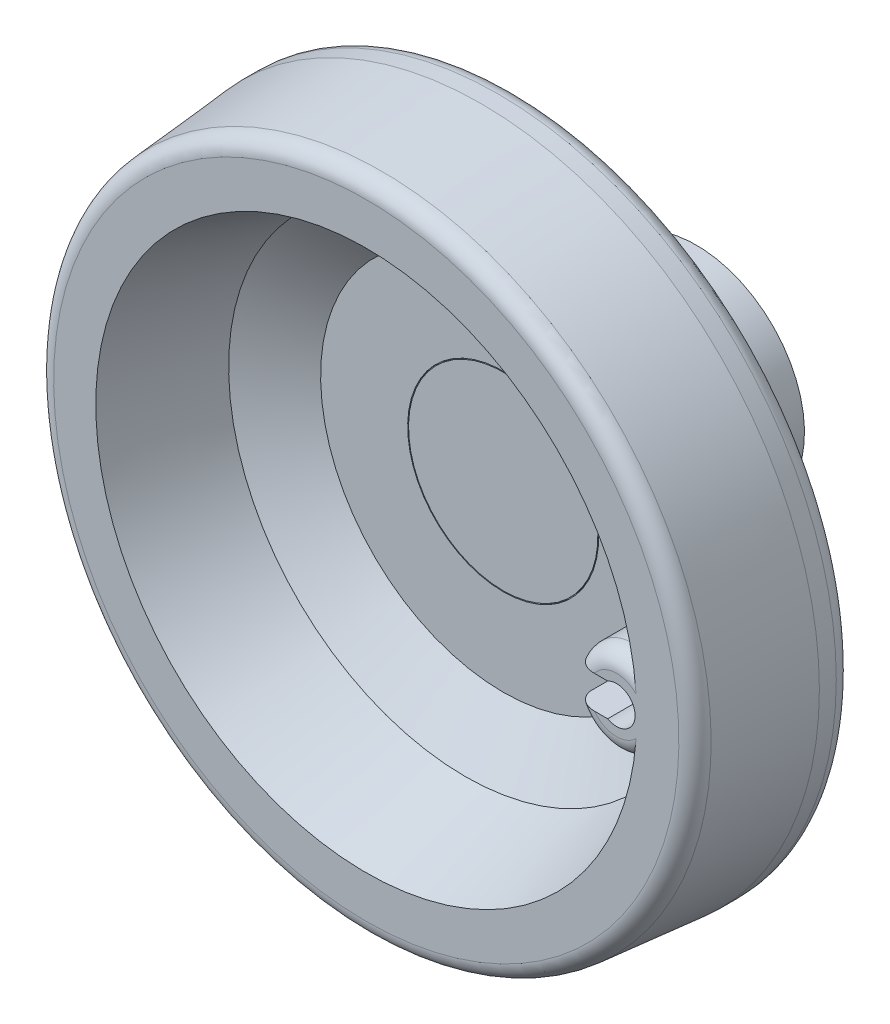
ISO-10303-21;
HEADER;
FILE_DESCRIPTION(('STEP AP214'),'2;1');
FILE_NAME('part.step','',(''),(''),'','','');
FILE_SCHEMA(('AUTOMOTIVE_DESIGN { 1 0 10303 214 1 1 1 1 }'));
ENDSEC;
DATA;
#1=APPLICATION_CONTEXT('core data for automotive mechanical design processes');
#2=APPLICATION_PROTOCOL_DEFINITION('international standard','automotive_design',2000,#1);
#3=PRODUCT_CONTEXT('',#1,'mechanical');
#4=PRODUCT('Part','Part','',(#3));
#5=PRODUCT_RELATED_PRODUCT_CATEGORY('part','',(#4));
#6=PRODUCT_DEFINITION_FORMATION('','',#4);
#7=PRODUCT_DEFINITION_CONTEXT('part definition',#1,'design');
#8=PRODUCT_DEFINITION('design','',#6,#7);
#9=PRODUCT_DEFINITION_SHAPE('','',#8);
#10=(LENGTH_UNIT() NAMED_UNIT(*) SI_UNIT(.MILLI.,.METRE.));
#11=(NAMED_UNIT(*) PLANE_ANGLE_UNIT() SI_UNIT($,.RADIAN.));
#12=(NAMED_UNIT(*) SI_UNIT($,.STERADIAN.) SOLID_ANGLE_UNIT());
#13=UNCERTAINTY_MEASURE_WITH_UNIT(LENGTH_MEASURE(1.E-05),#10,'distance_accuracy_value','');
#14=(GEOMETRIC_REPRESENTATION_CONTEXT(3) GLOBAL_UNCERTAINTY_ASSIGNED_CONTEXT((#13)) GLOBAL_UNIT_ASSIGNED_CONTEXT((#10,
#11,#12)) REPRESENTATION_CONTEXT('',''));
#15=CARTESIAN_POINT('',(0.,0.,0.));
#16=DIRECTION('',(0.,0.,1.));
#17=DIRECTION('',(1.,0.,0.));
#18=AXIS2_PLACEMENT_3D('',#15,#16,#17);
#19=CARTESIAN_POINT('',(37.,0.,41.66666674));
#20=DIRECTION('',(0.,0.,1.));
#21=DIRECTION('',(0.,-1.,0.));
#22=AXIS2_PLACEMENT_3D('',#19,#20,#21);
#23=CYLINDRICAL_SURFACE('',#22,2.74999999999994);
#24=CARTESIAN_POINT('',(35.9,2.52041663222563,44.599997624));
#25=CARTESIAN_POINT('',(35.9000064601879,2.52042258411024,44.5410709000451));
#26=CARTESIAN_POINT('',(35.9047630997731,2.5225123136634,44.4820608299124));
#27=CARTESIAN_POINT('',(35.923612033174,2.53061002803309,44.3657334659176));
#28=CARTESIAN_POINT('',(35.9377281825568,2.5366280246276,44.3084208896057));
#29=CARTESIAN_POINT('',(35.9746707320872,2.55178250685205,44.1973685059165));
#30=CARTESIAN_POINT('',(35.997464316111,2.56090722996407,44.1436161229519));
#31=CARTESIAN_POINT('',(36.0510188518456,2.58123065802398,44.0407108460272));
#32=CARTESIAN_POINT('',(36.0817780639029,2.5924289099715,43.991556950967));
#33=CARTESIAN_POINT('',(36.1522729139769,2.6163547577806,43.8964044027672));
#34=CARTESIAN_POINT('',(36.19239135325,2.62913154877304,43.8507015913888));
#35=CARTESIAN_POINT('',(36.2796599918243,2.6543685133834,43.7664566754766));
#36=CARTESIAN_POINT('',(36.3268126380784,2.66682857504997,43.7279170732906));
#37=CARTESIAN_POINT('',(36.429096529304,2.69061874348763,43.6576241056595));
#38=CARTESIAN_POINT('',(36.4844690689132,2.70188492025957,43.6261982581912));
#39=CARTESIAN_POINT('',(36.6002460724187,2.72142160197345,43.5732336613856));
#40=CARTESIAN_POINT('',(36.6606484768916,2.72969332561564,43.5516908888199));
#41=CARTESIAN_POINT('',(36.7816684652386,2.7419607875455,43.5201598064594));
#42=CARTESIAN_POINT('',(36.8421340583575,2.74614415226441,43.509662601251));
#43=CARTESIAN_POINT('',(36.9641035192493,2.75044170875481,43.4988819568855));
#44=CARTESIAN_POINT('',(37.025606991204,2.75055741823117,43.4985947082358));
#45=CARTESIAN_POINT('',(37.1442278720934,2.74682079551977,43.5079631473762));
#46=CARTESIAN_POINT('',(37.2013975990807,2.74319098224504,43.5170612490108));
#47=CARTESIAN_POINT('',(37.3133202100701,2.73267110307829,43.5439937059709));
#48=CARTESIAN_POINT('',(37.3680729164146,2.72578079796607,43.5618287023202));
#49=CARTESIAN_POINT('',(37.4745938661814,2.7092825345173,43.605947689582));
#50=CARTESIAN_POINT('',(37.5263046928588,2.69963518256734,43.6323549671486));
#51=CARTESIAN_POINT('',(37.6246944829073,2.67858021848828,43.6927533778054));
#52=CARTESIAN_POINT('',(37.6713717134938,2.66717200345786,43.7267471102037));
#53=CARTESIAN_POINT('',(37.7616228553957,2.6428690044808,43.8039546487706));
#54=CARTESIAN_POINT('',(37.8047918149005,2.62992579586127,43.8476272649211));
#55=CARTESIAN_POINT('',(37.8833590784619,2.60458913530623,43.9416424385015));
#56=CARTESIAN_POINT('',(37.9187548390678,2.59219586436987,43.9919871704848));
#57=CARTESIAN_POINT('',(37.9816973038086,2.56903293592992,44.0997280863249));
#58=CARTESIAN_POINT('',(38.0089940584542,2.55831902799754,44.1572832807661));
#59=CARTESIAN_POINT('',(38.0533469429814,2.54038174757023,44.2767161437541));
#60=CARTESIAN_POINT('',(38.0704097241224,2.53315610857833,44.3385909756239));
#61=CARTESIAN_POINT('',(38.0928252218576,2.52356367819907,44.4608673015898));
#62=CARTESIAN_POINT('',(38.0988296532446,2.52092701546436,44.5211278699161));
#63=CARTESIAN_POINT('',(38.1008587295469,2.52004223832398,44.6418400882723));
#64=CARTESIAN_POINT('',(38.0968864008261,2.52179279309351,44.7022916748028));
#65=CARTESIAN_POINT('',(38.0796680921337,2.52920824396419,44.8180500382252));
#66=CARTESIAN_POINT('',(38.0669631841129,2.53464451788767,44.8734537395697));
#67=CARTESIAN_POINT('',(38.0333423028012,2.54853528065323,44.9813062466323));
#68=CARTESIAN_POINT('',(38.0124245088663,2.55699043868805,45.033754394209));
#69=CARTESIAN_POINT('',(37.9620246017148,2.57638580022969,45.1365789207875));
#70=CARTESIAN_POINT('',(37.9322295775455,2.58741287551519,45.186785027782));
#71=CARTESIAN_POINT('',(37.865240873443,2.61057711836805,45.2817132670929));
#72=CARTESIAN_POINT('',(37.8280441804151,2.6227147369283,45.3264331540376));
#73=CARTESIAN_POINT('',(37.7440643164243,2.64781503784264,45.4125529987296));
#74=CARTESIAN_POINT('',(37.6967759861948,2.66077244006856,45.4534637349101));
#75=CARTESIAN_POINT('',(37.5956959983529,2.68520887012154,45.5268450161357));
#76=CARTESIAN_POINT('',(37.5419040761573,2.69668783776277,45.5593152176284));
#77=CARTESIAN_POINT('',(37.429153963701,2.71691043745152,45.6147738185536));
#78=CARTESIAN_POINT('',(37.3701970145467,2.72565472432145,45.6377644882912));
#79=CARTESIAN_POINT('',(37.2488164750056,2.73939992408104,45.6733494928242));
#80=CARTESIAN_POINT('',(37.1863947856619,2.74440286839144,45.685949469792));
#81=CARTESIAN_POINT('',(37.0642490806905,2.74988454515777,45.699725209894));
#82=CARTESIAN_POINT('',(37.0046147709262,2.75063715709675,45.7015926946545));
#83=CARTESIAN_POINT('',(36.8859113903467,2.7482732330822,45.6956771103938));
#84=CARTESIAN_POINT('',(36.826842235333,2.74515728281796,45.687895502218));
#85=CARTESIAN_POINT('',(36.7128060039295,2.73554332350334,45.6633968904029));
#86=CARTESIAN_POINT('',(36.6577686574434,2.72915214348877,45.6469617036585));
#87=CARTESIAN_POINT('',(36.5512427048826,2.71367221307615,45.605918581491));
#88=CARTESIAN_POINT('',(36.499754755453,2.704582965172,45.5813091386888));
#89=CARTESIAN_POINT('',(36.3992883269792,2.68409951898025,45.5233908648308));
#90=CARTESIAN_POINT('',(36.3505212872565,2.67262121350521,45.4897456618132));
#91=CARTESIAN_POINT('',(36.2591202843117,2.6487417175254,45.4152139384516));
#92=CARTESIAN_POINT('',(36.2164888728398,2.63634014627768,45.3743244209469));
#93=CARTESIAN_POINT('',(36.1358393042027,2.61105769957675,45.2834742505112));
#94=CARTESIAN_POINT('',(36.0982701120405,2.59819467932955,45.2331087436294));
#95=CARTESIAN_POINT('',(36.0320839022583,2.57427319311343,45.1263794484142));
#96=CARTESIAN_POINT('',(36.003467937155,2.56321493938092,45.0700149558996));
#97=CARTESIAN_POINT('',(35.9583049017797,2.54517375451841,44.9580271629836));
#98=CARTESIAN_POINT('',(35.9409048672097,2.53791405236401,44.9027917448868));
#99=CARTESIAN_POINT('',(35.9150052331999,2.52695301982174,44.7900306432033));
#100=CARTESIAN_POINT('',(35.9064808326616,2.52324177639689,44.7325118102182));
#101=CARTESIAN_POINT('',(35.9008446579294,2.52078452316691,44.6498399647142));
#102=CARTESIAN_POINT('',(35.8999972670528,2.52041411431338,44.6249262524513));
#103=CARTESIAN_POINT('',(35.9,2.52041663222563,44.599997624));
#104=B_SPLINE_CURVE_WITH_KNOTS('',3,(#24,#25,#26,#27,#28,#29,#30,#31,#32,#33,#34,#35,#36,#37,
#38,#39,#40,#41,#42,#43,#44,#45,#46,#47,#48,#49,#50,#51,#52,#53,#54,#55,#56,#57,#58,#59,#60,#61,
#62,#63,#64,#65,#66,#67,#68,#69,#70,#71,#72,#73,#74,#75,#76,#77,#78,#79,#80,#81,#82,#83,#84,#85,
#86,#87,#88,#89,#90,#91,#92,#93,#94,#95,#96,#97,#98,#99,#100,#101,#102,#103),.UNSPECIFIED.,.T.,
.F.,(4,2,2,2,2,2,2,2,2,2,2,2,2,2,2,2,2,2,2,2,2,2,2,2,2,2,2,2,2,2,2,2,2,2,2,2,2,2,2,4),(0.,
0.17670270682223,0.353857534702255,0.530348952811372,0.706801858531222,0.892405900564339,
1.07807465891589,1.27106468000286,1.46397606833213,1.64754800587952,1.83105144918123,
2.00424754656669,2.17745635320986,2.35327565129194,2.52915528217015,2.71658224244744,
2.90407043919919,3.09685452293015,3.28951317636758,3.47040181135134,3.6512355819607,
3.82176986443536,3.99234197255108,4.16983135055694,4.34739312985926,4.53807053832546,
4.72875570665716,4.91939518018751,5.10993106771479,5.28803571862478,5.46611340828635,
5.63872096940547,5.81136037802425,5.99162878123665,6.17197194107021,6.36347939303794,
6.55500934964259,6.72934163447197,6.90318546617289,6.97793858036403),.UNSPECIFIED.);
#105=CARTESIAN_POINT('',(35.9,2.52041663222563,44.599997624));
#106=VERTEX_POINT('',#105);
#107=EDGE_CURVE('E27',#106,#106,#104,.T.);
#108=ORIENTED_EDGE('',*,*,#107,.F.);
#109=EDGE_LOOP('',(#108));
#110=FACE_BOUND('',#109,.T.);
#111=CARTESIAN_POINT('',(37.,0.,49.));
#112=DIRECTION('',(0.,0.,1.));
#113=DIRECTION('',(0.,-1.,0.));
#114=AXIS2_PLACEMENT_3D('',#111,#112,#113);
#115=CIRCLE('',#114,2.74999999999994);
#116=CARTESIAN_POINT('',(35.693822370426,-2.42,49.));
#117=VERTEX_POINT('',#116);
#118=CARTESIAN_POINT('',(35.693822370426,2.42,49.));
#119=VERTEX_POINT('',#118);
#120=EDGE_CURVE('E112',#117,#119,#115,.T.);
#121=ORIENTED_EDGE('',*,*,#120,.T.);
#122=DIRECTION('',(0.,0.,1.));
#123=VECTOR('',#122,1.);
#124=CARTESIAN_POINT('',(35.693822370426,2.42,41.66666674));
#125=LINE('',#124,#123);
#126=CARTESIAN_POINT('',(35.693822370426,2.42,41.66666674));
#127=VERTEX_POINT('',#126);
#128=EDGE_CURVE('E102',#127,#119,#125,.T.);
#129=ORIENTED_EDGE('',*,*,#128,.F.);
#130=CARTESIAN_POINT('',(37.,0.,41.66666674));
#131=DIRECTION('',(0.,0.,1.));
#132=DIRECTION('',(0.,-1.,0.));
#133=AXIS2_PLACEMENT_3D('',#130,#131,#132);
#134=CIRCLE('',#133,2.74999999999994);
#135=CARTESIAN_POINT('',(35.693822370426,-2.42,41.66666674));
#136=VERTEX_POINT('',#135);
#137=EDGE_CURVE('E89',#136,#127,#134,.T.);
#138=ORIENTED_EDGE('',*,*,#137,.F.);
#139=DIRECTION('',(0.,0.,1.));
#140=VECTOR('',#139,1.);
#141=CARTESIAN_POINT('',(35.693822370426,-2.42,41.66666674));
#142=LINE('',#141,#140);
#143=EDGE_CURVE('E95',#136,#117,#142,.T.);
#144=ORIENTED_EDGE('',*,*,#143,.T.);
#145=EDGE_LOOP('',(#121,#129,#138,#144));
#146=FACE_BOUND('',#145,.T.);
#147=CARTESIAN_POINT('',(35.9,-2.52041663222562,44.599997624));
#148=CARTESIAN_POINT('',(35.9000064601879,-2.52042258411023,44.658924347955));
#149=CARTESIAN_POINT('',(35.9047630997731,-2.5225123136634,44.7179344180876));
#150=CARTESIAN_POINT('',(35.923612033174,-2.53061002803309,44.8342617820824));
#151=CARTESIAN_POINT('',(35.9377281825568,-2.5366280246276,44.8915743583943));
#152=CARTESIAN_POINT('',(35.9746707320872,-2.55178250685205,45.0026267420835));
#153=CARTESIAN_POINT('',(35.997464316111,-2.56090722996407,45.0563791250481));
#154=CARTESIAN_POINT('',(36.0510188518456,-2.58123065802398,45.1592844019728));
#155=CARTESIAN_POINT('',(36.0817780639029,-2.5924289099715,45.208438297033));
#156=CARTESIAN_POINT('',(36.1522729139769,-2.6163547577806,45.3035908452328));
#157=CARTESIAN_POINT('',(36.1923913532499,-2.62913154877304,45.3492936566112));
#158=CARTESIAN_POINT('',(36.2796599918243,-2.6543685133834,45.4335385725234));
#159=CARTESIAN_POINT('',(36.3268126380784,-2.66682857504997,45.4720781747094));
#160=CARTESIAN_POINT('',(36.429096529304,-2.69061874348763,45.5423711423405));
#161=CARTESIAN_POINT('',(36.4844690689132,-2.70188492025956,45.5737969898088));
#162=CARTESIAN_POINT('',(36.6002460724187,-2.72142160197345,45.6267615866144));
#163=CARTESIAN_POINT('',(36.6606484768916,-2.72969332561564,45.6483043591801));
#164=CARTESIAN_POINT('',(36.7816684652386,-2.7419607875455,45.6798354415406));
#165=CARTESIAN_POINT('',(36.8421340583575,-2.74614415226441,45.690332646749));
#166=CARTESIAN_POINT('',(36.9641035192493,-2.75044170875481,45.7011132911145));
#167=CARTESIAN_POINT('',(37.025606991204,-2.75055741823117,45.7014005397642));
#168=CARTESIAN_POINT('',(37.1442278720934,-2.74682079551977,45.6920321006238));
#169=CARTESIAN_POINT('',(37.2013975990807,-2.74319098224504,45.6829339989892));
#170=CARTESIAN_POINT('',(37.3133202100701,-2.73267110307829,45.6560015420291));
#171=CARTESIAN_POINT('',(37.3680729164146,-2.72578079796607,45.6381665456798));
#172=CARTESIAN_POINT('',(37.4745938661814,-2.7092825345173,45.5940475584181));
#173=CARTESIAN_POINT('',(37.5263046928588,-2.69963518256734,45.5676402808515));
#174=CARTESIAN_POINT('',(37.6246944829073,-2.67858021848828,45.5072418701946));
#175=CARTESIAN_POINT('',(37.6713717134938,-2.66717200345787,45.4732481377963));
#176=CARTESIAN_POINT('',(37.7616228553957,-2.6428690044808,45.3960405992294));
#177=CARTESIAN_POINT('',(37.8047918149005,-2.62992579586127,45.3523679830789));
#178=CARTESIAN_POINT('',(37.8833590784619,-2.60458913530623,45.2583528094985));
#179=CARTESIAN_POINT('',(37.9187548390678,-2.59219586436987,45.2080080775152));
#180=CARTESIAN_POINT('',(37.9816973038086,-2.56903293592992,45.1002671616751));
#181=CARTESIAN_POINT('',(38.0089940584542,-2.55831902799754,45.0427119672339));
#182=CARTESIAN_POINT('',(38.0533469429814,-2.54038174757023,44.9232791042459));
#183=CARTESIAN_POINT('',(38.0704097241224,-2.53315610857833,44.8614042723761));
#184=CARTESIAN_POINT('',(38.0928252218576,-2.52356367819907,44.7391279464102));
#185=CARTESIAN_POINT('',(38.0988296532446,-2.52092701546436,44.6788673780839));
#186=CARTESIAN_POINT('',(38.1008587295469,-2.52004223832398,44.5581551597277));
#187=CARTESIAN_POINT('',(38.0968864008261,-2.52179279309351,44.4977035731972));
#188=CARTESIAN_POINT('',(38.0796680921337,-2.52920824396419,44.3819452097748));
#189=CARTESIAN_POINT('',(38.0669631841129,-2.53464451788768,44.3265415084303));
#190=CARTESIAN_POINT('',(38.0333423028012,-2.54853528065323,44.2186890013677));
#191=CARTESIAN_POINT('',(38.0124245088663,-2.55699043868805,44.166240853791));
#192=CARTESIAN_POINT('',(37.9620246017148,-2.57638580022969,44.0634163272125));
#193=CARTESIAN_POINT('',(37.9322295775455,-2.58741287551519,44.013210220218));
#194=CARTESIAN_POINT('',(37.865240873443,-2.61057711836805,43.9182819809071));
#195=CARTESIAN_POINT('',(37.8280441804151,-2.6227147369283,43.8735620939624));
#196=CARTESIAN_POINT('',(37.7440643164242,-2.64781503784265,43.7874422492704));
#197=CARTESIAN_POINT('',(37.6967759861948,-2.66077244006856,43.7465315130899));
#198=CARTESIAN_POINT('',(37.5956959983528,-2.68520887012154,43.6731502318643));
#199=CARTESIAN_POINT('',(37.5419040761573,-2.69668783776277,43.6406800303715));
#200=CARTESIAN_POINT('',(37.429153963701,-2.71691043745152,43.5852214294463));
#201=CARTESIAN_POINT('',(37.3701970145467,-2.72565472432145,43.5622307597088));
#202=CARTESIAN_POINT('',(37.2488164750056,-2.73939992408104,43.5266457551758));
#203=CARTESIAN_POINT('',(37.1863947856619,-2.74440286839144,43.514045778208));
#204=CARTESIAN_POINT('',(37.0642490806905,-2.74988454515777,43.500270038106));
#205=CARTESIAN_POINT('',(37.0046147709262,-2.75063715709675,43.4984025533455));
#206=CARTESIAN_POINT('',(36.8859113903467,-2.7482732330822,43.5043181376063));
#207=CARTESIAN_POINT('',(36.826842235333,-2.74515728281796,43.5120997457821));
#208=CARTESIAN_POINT('',(36.7128060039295,-2.73554332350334,43.5365983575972));
#209=CARTESIAN_POINT('',(36.6577686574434,-2.72915214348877,43.5530335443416));
#210=CARTESIAN_POINT('',(36.5512427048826,-2.71367221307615,43.594076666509));
#211=CARTESIAN_POINT('',(36.499754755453,-2.70458296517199,43.6186861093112));
#212=CARTESIAN_POINT('',(36.3992883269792,-2.68409951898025,43.6766043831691));
#213=CARTESIAN_POINT('',(36.3505212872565,-2.67262121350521,43.7102495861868));
#214=CARTESIAN_POINT('',(36.2591202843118,-2.64874171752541,43.7847813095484));
#215=CARTESIAN_POINT('',(36.2164888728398,-2.63634014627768,43.8256708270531));
#216=CARTESIAN_POINT('',(36.1358393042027,-2.61105769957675,43.9165209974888));
#217=CARTESIAN_POINT('',(36.0982701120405,-2.59819467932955,43.9668865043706));
#218=CARTESIAN_POINT('',(36.0320839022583,-2.57427319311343,44.0736157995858));
#219=CARTESIAN_POINT('',(36.003467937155,-2.56321493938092,44.1299802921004));
#220=CARTESIAN_POINT('',(35.9583049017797,-2.54517375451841,44.2419680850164));
#221=CARTESIAN_POINT('',(35.9409048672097,-2.537914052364,44.2972035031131));
#222=CARTESIAN_POINT('',(35.9150052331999,-2.52695301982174,44.4099646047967));
#223=CARTESIAN_POINT('',(35.9064808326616,-2.52324177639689,44.4674834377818));
#224=CARTESIAN_POINT('',(35.9008446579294,-2.52078452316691,44.5501552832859));
#225=CARTESIAN_POINT('',(35.8999972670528,-2.52041411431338,44.5750689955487));
#226=CARTESIAN_POINT('',(35.9,-2.52041663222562,44.599997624));
#227=B_SPLINE_CURVE_WITH_KNOTS('',3,(#147,#148,#149,#150,#151,#152,#153,#154,#155,#156,#157,
#158,#159,#160,#161,#162,#163,#164,#165,#166,#167,#168,#169,#170,#171,#172,#173,#174,#175,#176,
#177,#178,#179,#180,#181,#182,#183,#184,#185,#186,#187,#188,#189,#190,#191,#192,#193,#194,#195,
#196,#197,#198,#199,#200,#201,#202,#203,#204,#205,#206,#207,#208,#209,#210,#211,#212,#213,#214,
#215,#216,#217,#218,#219,#220,#221,#222,#223,#224,#225,#226),.UNSPECIFIED.,.T.,.F.,(4,2,2,2,2,2,
2,2,2,2,2,2,2,2,2,2,2,2,2,2,2,2,2,2,2,2,2,2,2,2,2,2,2,2,2,2,2,2,2,4),(0.,0.176702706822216,
0.353857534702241,0.530348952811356,0.70680185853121,0.892405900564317,1.07807465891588,
1.27106468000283,1.46397606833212,1.6475480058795,1.83105144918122,2.00424754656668,
2.17745635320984,2.35327565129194,2.52915528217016,2.71658224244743,2.90407043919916,
3.09685452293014,3.2895131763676,3.47040181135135,3.65123558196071,3.82176986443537,
3.99234197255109,4.16983135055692,4.34739312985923,4.53807053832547,4.72875570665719,
4.91939518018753,5.10993106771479,5.28803571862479,5.46611340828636,5.63872096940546,
5.81136037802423,5.99162878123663,6.17197194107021,6.36347939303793,6.55500934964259,
6.72934163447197,6.90318546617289,6.97793858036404),.UNSPECIFIED.);
#228=CARTESIAN_POINT('',(35.9,-2.52041663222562,44.599997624));
#229=VERTEX_POINT('',#228);
#230=EDGE_CURVE('E9',#229,#229,#227,.T.);
#231=ORIENTED_EDGE('',*,*,#230,.F.);
#232=EDGE_LOOP('',(#231));
#233=FACE_BOUND('',#232,.T.);
#234=ADVANCED_FACE('F14',(#110,#146,#233),#23,.F.);
#235=CARTESIAN_POINT('',(37.,0.,46.4600000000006));
#236=DIRECTION('',(0.,0.,-1.));
#237=DIRECTION('',(0.,1.,0.));
#238=AXIS2_PLACEMENT_3D('',#235,#236,#237);
#239=TOROIDAL_SURFACE('',#238,4.06000000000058,2.53999999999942);
#240=CARTESIAN_POINT('',(37.,0.,46.46));
#241=DIRECTION('',(0.,0.,-1.));
#242=DIRECTION('',(0.,1.,0.));
#243=AXIS2_PLACEMENT_3D('',#240,#241,#242);
#244=CIRCLE('',#243,6.6);
#245=CARTESIAN_POINT('',(30.8596742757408,2.42,46.46));
#246=VERTEX_POINT('',#245);
#247=CARTESIAN_POINT('',(38.605841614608,6.40166171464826,46.46));
#248=VERTEX_POINT('',#247);
#249=EDGE_CURVE('E123',#246,#248,#244,.T.);
#250=ORIENTED_EDGE('',*,*,#249,.F.);
#251=CARTESIAN_POINT('',(32.6182202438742,2.42,48.8174079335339));
#252=CARTESIAN_POINT('',(32.7206798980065,2.42,48.8533846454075));
#253=CARTESIAN_POINT('',(32.825107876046,2.42,48.883806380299));
#254=CARTESIAN_POINT('',(33.0365713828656,2.42,48.9338647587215));
#255=CARTESIAN_POINT('',(33.1436090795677,2.42,48.9534920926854));
#256=CARTESIAN_POINT('',(33.3589011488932,2.42,48.9824792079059));
#257=CARTESIAN_POINT('',(33.4671537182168,2.42,48.9918525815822));
#258=CARTESIAN_POINT('',(33.6840808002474,2.42,49.0011590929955));
#259=CARTESIAN_POINT('',(33.7927554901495,2.42,49.0010877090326));
#260=CARTESIAN_POINT('',(34.0724041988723,2.42,48.9899330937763));
#261=CARTESIAN_POINT('',(34.2431289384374,2.42,48.9725171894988));
#262=CARTESIAN_POINT('',(34.5820005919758,2.42,48.9210422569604));
#263=CARTESIAN_POINT('',(34.750145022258,2.42,48.8869681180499));
#264=CARTESIAN_POINT('',(35.0012867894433,2.42,48.8274888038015));
#265=CARTESIAN_POINT('',(35.0852953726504,2.42,48.8061220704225));
#266=CARTESIAN_POINT('',(35.2528174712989,2.42,48.7615183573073));
#267=CARTESIAN_POINT('',(35.3363309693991,2.42,48.7382813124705));
#268=CARTESIAN_POINT('',(35.503131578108,2.42,48.690965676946));
#269=CARTESIAN_POINT('',(35.5864186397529,2.42,48.6668869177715));
#270=CARTESIAN_POINT('',(35.7531044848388,2.42,48.6191283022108));
#271=CARTESIAN_POINT('',(35.8365032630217,2.42,48.5954484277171));
#272=CARTESIAN_POINT('',(36.0308069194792,2.42,48.5425982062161));
#273=CARTESIAN_POINT('',(36.1419064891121,2.42,48.5141207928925));
#274=CARTESIAN_POINT('',(36.3657558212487,2.42,48.4645043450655));
#275=CARTESIAN_POINT('',(36.4785040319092,2.42,48.443358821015));
#276=CARTESIAN_POINT('',(36.6479367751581,2.42,48.4203656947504));
#277=CARTESIAN_POINT('',(36.7040276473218,2.42,48.4141708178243));
#278=CARTESIAN_POINT('',(36.8164625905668,2.42,48.4049160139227));
#279=CARTESIAN_POINT('',(36.8728066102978,2.42,48.401855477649));
#280=CARTESIAN_POINT('',(36.9855707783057,2.42,48.3990703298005));
#281=CARTESIAN_POINT('',(37.0419909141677,2.42,48.3993452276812));
#282=CARTESIAN_POINT('',(37.1547140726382,2.42,48.403204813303));
#283=CARTESIAN_POINT('',(37.2110170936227,2.42,48.4067895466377));
#284=CARTESIAN_POINT('',(37.3675573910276,2.42,48.4211053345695));
#285=CARTESIAN_POINT('',(37.4674872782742,2.42,48.4352406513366));
#286=CARTESIAN_POINT('',(37.6659881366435,2.42,48.4709728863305));
#287=CARTESIAN_POINT('',(37.7645580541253,2.42,48.4925752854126));
#288=CARTESIAN_POINT('',(37.9620896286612,2.42,48.5406522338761));
#289=CARTESIAN_POINT('',(38.0610334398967,2.42,48.567197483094));
#290=CARTESIAN_POINT('',(38.2583516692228,2.42,48.6221849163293));
#291=CARTESIAN_POINT('',(38.3567261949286,2.42,48.6506267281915));
#292=CARTESIAN_POINT('',(38.6025391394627,2.42,48.7211822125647));
#293=CARTESIAN_POINT('',(38.750050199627,2.42,48.7630616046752));
#294=CARTESIAN_POINT('',(39.0469092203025,2.42,48.8400893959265));
#295=CARTESIAN_POINT('',(39.1962572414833,2.42,48.8752375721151));
#296=CARTESIAN_POINT('',(39.4957564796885,2.42,48.934001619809));
#297=CARTESIAN_POINT('',(39.645885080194,2.42,48.9577282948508));
#298=CARTESIAN_POINT('',(39.9477560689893,2.42,48.9905472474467));
#299=CARTESIAN_POINT('',(40.0994971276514,2.42,48.9996507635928));
#300=CARTESIAN_POINT('',(40.3395657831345,2.42,49.0001881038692));
#301=CARTESIAN_POINT('',(40.4278952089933,2.42,48.9974160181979));
#302=CARTESIAN_POINT('',(40.6041102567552,2.42,48.9854673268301));
#303=CARTESIAN_POINT('',(40.6919960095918,2.42,48.9762927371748));
#304=CARTESIAN_POINT('',(40.8670570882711,2.42,48.9511034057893));
#305=CARTESIAN_POINT('',(40.9542295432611,2.42,48.9350685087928));
#306=CARTESIAN_POINT('',(41.126924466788,2.42,48.8958574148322));
#307=CARTESIAN_POINT('',(41.2124476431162,2.42,48.8726843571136));
#308=CARTESIAN_POINT('',(41.3818277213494,2.42,48.8187794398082));
#309=CARTESIAN_POINT('',(41.4656663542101,2.42,48.7879898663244));
#310=CARTESIAN_POINT('',(41.6301391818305,2.42,48.7188748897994));
#311=CARTESIAN_POINT('',(41.7107749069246,2.42,48.6805531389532));
#312=CARTESIAN_POINT('',(41.8679888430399,2.42,48.5964239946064));
#313=CARTESIAN_POINT('',(41.9445698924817,2.42,48.5506219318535));
#314=CARTESIAN_POINT('',(42.092828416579,2.42,48.4517255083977));
#315=CARTESIAN_POINT('',(42.164506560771,2.42,48.3986321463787));
#316=CARTESIAN_POINT('',(42.3560967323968,2.42,48.2409897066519));
#317=CARTESIAN_POINT('',(42.4698186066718,2.42,48.1287078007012));
#318=CARTESIAN_POINT('',(42.6740008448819,2.42,47.8847599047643));
#319=CARTESIAN_POINT('',(42.7644732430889,2.42,47.753103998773));
#320=CARTESIAN_POINT('',(42.9100811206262,2.42,47.4893321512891));
#321=CARTESIAN_POINT('',(42.9679252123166,2.42,47.3587086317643));
#322=CARTESIAN_POINT('',(43.0595114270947,2.42,47.0892848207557));
#323=CARTESIAN_POINT('',(43.0932637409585,2.42,46.950488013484));
#324=CARTESIAN_POINT('',(43.134268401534,2.42,46.6763132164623));
#325=CARTESIAN_POINT('',(43.142787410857,2.42,46.5411232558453));
#326=CARTESIAN_POINT('',(43.1366391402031,2.42,46.2712810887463));
#327=CARTESIAN_POINT('',(43.1219750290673,2.42,46.1366288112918));
#328=CARTESIAN_POINT('',(43.0703803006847,2.42,45.8737202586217));
#329=CARTESIAN_POINT('',(43.033777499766,2.42,45.745399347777));
#330=CARTESIAN_POINT('',(42.9398592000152,2.42,45.4965869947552));
#331=CARTESIAN_POINT('',(42.8825424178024,2.42,45.3760960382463));
#332=CARTESIAN_POINT('',(42.7480942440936,2.42,45.1442602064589));
#333=CARTESIAN_POINT('',(42.6706713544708,2.42,45.033084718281));
#334=CARTESIAN_POINT('',(42.4990329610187,2.42,44.8246277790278));
#335=CARTESIAN_POINT('',(42.404818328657,2.42,44.7273456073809));
#336=CARTESIAN_POINT('',(42.1978504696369,2.42,44.5444697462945));
#337=CARTESIAN_POINT('',(42.0844466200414,2.42,44.4596137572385));
#338=CARTESIAN_POINT('',(41.8458573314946,2.42,44.3084006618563));
#339=CARTESIAN_POINT('',(41.7206606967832,2.42,44.2420613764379));
#340=CARTESIAN_POINT('',(41.4508671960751,2.42,44.1235122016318));
#341=CARTESIAN_POINT('',(41.3055265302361,2.42,44.072991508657));
#342=CARTESIAN_POINT('',(41.0834936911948,2.42,44.0136320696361));
#343=CARTESIAN_POINT('',(41.0088681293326,2.42,43.9965889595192));
#344=CARTESIAN_POINT('',(40.8586064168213,2.42,43.9677435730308));
#345=CARTESIAN_POINT('',(40.7829703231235,2.42,43.955941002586));
#346=CARTESIAN_POINT('',(40.5942330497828,2.42,43.9328640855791));
#347=CARTESIAN_POINT('',(40.4807559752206,2.42,43.9246232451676));
#348=CARTESIAN_POINT('',(40.2534517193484,2.42,43.9183260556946));
#349=CARTESIAN_POINT('',(40.1396243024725,2.42,43.9202798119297));
#350=CARTESIAN_POINT('',(39.9112947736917,2.42,43.9333223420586));
#351=CARTESIAN_POINT('',(39.7967985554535,2.42,43.9445090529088));
#352=CARTESIAN_POINT('',(39.5690758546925,2.42,43.9747358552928));
#353=CARTESIAN_POINT('',(39.4558475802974,2.42,43.9937628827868));
#354=CARTESIAN_POINT('',(39.2241197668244,2.42,44.0393674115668));
#355=CARTESIAN_POINT('',(39.1056956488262,2.42,44.0663190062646));
#356=CARTESIAN_POINT('',(38.8700560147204,2.42,44.1250410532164));
#357=CARTESIAN_POINT('',(38.7528407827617,2.42,44.156812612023));
#358=CARTESIAN_POINT('',(38.5185653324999,2.42,44.2226343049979));
#359=CARTESIAN_POINT('',(38.4015075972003,2.42,44.2566930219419));
#360=CARTESIAN_POINT('',(38.1669664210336,2.42,44.3235984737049));
#361=CARTESIAN_POINT('',(38.0494827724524,2.42,44.3564444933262));
#362=CARTESIAN_POINT('',(37.8150350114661,2.42,44.4159966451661));
#363=CARTESIAN_POINT('',(37.698097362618,2.42,44.442799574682));
#364=CARTESIAN_POINT('',(37.5213183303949,2.42,44.4752552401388));
#365=CARTESIAN_POINT('',(37.4622008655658,2.42,44.4847787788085));
#366=CARTESIAN_POINT('',(37.3435515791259,2.42,44.5006901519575));
#367=CARTESIAN_POINT('',(37.2840198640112,2.42,44.5070787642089));
#368=CARTESIAN_POINT('',(37.1651370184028,2.42,44.5162570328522));
#369=CARTESIAN_POINT('',(37.1057880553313,2.42,44.5190741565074));
#370=CARTESIAN_POINT('',(36.9870295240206,2.42,44.5209983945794));
#371=CARTESIAN_POINT('',(36.9276199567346,2.42,44.5201055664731));
#372=CARTESIAN_POINT('',(36.8089220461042,2.42,44.5146721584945));
#373=CARTESIAN_POINT('',(36.7496338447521,2.42,44.5101285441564));
#374=CARTESIAN_POINT('',(36.6314120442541,2.42,44.4977086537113));
#375=CARTESIAN_POINT('',(36.5724784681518,2.42,44.4898321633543));
#376=CARTESIAN_POINT('',(36.4044882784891,2.42,44.4632200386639));
#377=CARTESIAN_POINT('',(36.2959948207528,2.42,44.4409752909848));
#378=CARTESIAN_POINT('',(36.0804861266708,2.42,44.3904546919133));
#379=CARTESIAN_POINT('',(35.9734713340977,2.42,44.3621770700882));
#380=CARTESIAN_POINT('',(35.7590963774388,2.42,44.3028675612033));
#381=CARTESIAN_POINT('',(35.6517431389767,2.42,44.2718113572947));
#382=CARTESIAN_POINT('',(35.4369396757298,2.42,44.2101421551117));
#383=CARTESIAN_POINT('',(35.3294894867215,2.42,44.1795290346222));
#384=CARTESIAN_POINT('',(35.1122931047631,2.42,44.1206768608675));
#385=CARTESIAN_POINT('',(35.0025359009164,2.42,44.0924773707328));
#386=CARTESIAN_POINT('',(34.7818391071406,2.42,44.0409492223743));
#387=CARTESIAN_POINT('',(34.6708993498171,2.42,44.01762126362));
#388=CARTESIAN_POINT('',(34.4483215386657,2.42,43.9776340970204));
#389=CARTESIAN_POINT('',(34.3366890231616,2.42,43.9609447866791));
#390=CARTESIAN_POINT('',(34.1125411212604,2.42,43.9355404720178));
#391=CARTESIAN_POINT('',(34.0000262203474,2.42,43.9268213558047));
#392=CARTESIAN_POINT('',(33.8038473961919,2.42,43.9196619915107));
#393=CARTESIAN_POINT('',(33.7202604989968,2.42,43.9191440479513));
#394=CARTESIAN_POINT('',(33.5532032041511,2.42,43.9235967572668));
#395=CARTESIAN_POINT('',(33.4697328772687,2.42,43.9285699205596));
#396=CARTESIAN_POINT('',(33.2196080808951,2.42,43.9523840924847));
#397=CARTESIAN_POINT('',(33.0536702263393,2.42,43.9801397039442));
#398=CARTESIAN_POINT('',(32.7272149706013,2.42,44.061870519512));
#399=CARTESIAN_POINT('',(32.566736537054,2.42,44.1160036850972));
#400=CARTESIAN_POINT('',(32.2578340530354,2.42,44.2512896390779));
#401=CARTESIAN_POINT('',(32.1093852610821,2.42,44.3323851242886));
#402=CARTESIAN_POINT('',(31.8335078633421,2.42,44.5184754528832));
#403=CARTESIAN_POINT('',(31.70565178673,2.42,44.6228328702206));
#404=CARTESIAN_POINT('',(31.4720946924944,2.42,44.8541503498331));
#405=CARTESIAN_POINT('',(31.366398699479,2.42,44.9811155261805));
#406=CARTESIAN_POINT('',(31.1929278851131,2.42,45.2376650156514));
#407=CARTESIAN_POINT('',(31.1221800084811,2.42,45.3652455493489));
#408=CARTESIAN_POINT('',(31.0047720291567,2.42,45.6310005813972));
#409=CARTESIAN_POINT('',(30.9580943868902,2.42,45.7691672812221));
#410=CARTESIAN_POINT('',(30.8927930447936,2.42,46.0428722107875));
#411=CARTESIAN_POINT('',(30.8726046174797,2.42,46.1780391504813));
#412=CARTESIAN_POINT('',(30.8557801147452,2.42,46.4498332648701));
#413=CARTESIAN_POINT('',(30.8591414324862,2.42,46.5864602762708));
#414=CARTESIAN_POINT('',(30.8889474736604,2.42,46.8540359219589));
#415=CARTESIAN_POINT('',(30.9148706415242,2.42,46.985043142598));
#416=CARTESIAN_POINT('',(30.9881742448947,2.42,47.2408858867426));
#417=CARTESIAN_POINT('',(31.035552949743,2.42,47.3657219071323));
#418=CARTESIAN_POINT('',(31.1506026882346,2.42,47.6068775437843));
#419=CARTESIAN_POINT('',(31.2184339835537,2.42,47.7231205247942));
#420=CARTESIAN_POINT('',(31.3720015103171,2.42,47.9431316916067));
#421=CARTESIAN_POINT('',(31.4577448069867,2.42,48.0468949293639));
#422=CARTESIAN_POINT('',(31.6480135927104,2.42,48.2433972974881));
#423=CARTESIAN_POINT('',(31.7531363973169,2.42,48.335556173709));
#424=CARTESIAN_POINT('',(31.9763632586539,2.42,48.5022157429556));
#425=CARTESIAN_POINT('',(32.0944529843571,2.42,48.5767356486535));
#426=CARTESIAN_POINT('',(32.2817559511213,2.42,48.6763231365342));
#427=CARTESIAN_POINT('',(32.3475245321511,2.42,48.7080612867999));
#428=CARTESIAN_POINT('',(32.4813047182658,2.42,48.7665079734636));
#429=CARTESIAN_POINT('',(32.5493174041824,2.42,48.7932140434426));
#430=CARTESIAN_POINT('',(32.6182202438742,2.42,48.8174079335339));
#431=B_SPLINE_CURVE_WITH_KNOTS('',3,(#251,#252,#253,#254,#255,#256,#257,#258,#259,#260,#261,
#262,#263,#264,#265,#266,#267,#268,#269,#270,#271,#272,#273,#274,#275,#276,#277,#278,#279,#280,
#281,#282,#283,#284,#285,#286,#287,#288,#289,#290,#291,#292,#293,#294,#295,#296,#297,#298,#299,
#300,#301,#302,#303,#304,#305,#306,#307,#308,#309,#310,#311,#312,#313,#314,#315,#316,#317,#318,
#319,#320,#321,#322,#323,#324,#325,#326,#327,#328,#329,#330,#331,#332,#333,#334,#335,#336,#337,
#338,#339,#340,#341,#342,#343,#344,#345,#346,#347,#348,#349,#350,#351,#352,#353,#354,#355,#356,
#357,#358,#359,#360,#361,#362,#363,#364,#365,#366,#367,#368,#369,#370,#371,#372,#373,#374,#375,
#376,#377,#378,#379,#380,#381,#382,#383,#384,#385,#386,#387,#388,#389,#390,#391,#392,#393,#394,
#395,#396,#397,#398,#399,#400,#401,#402,#403,#404,#405,#406,#407,#408,#409,#410,#411,#412,#413,
#414,#415,#416,#417,#418,#419,#420,#421,#422,#423,#424,#425,#426,#427,#428,#429,#430),
.UNSPECIFIED.,.T.,.F.,(4,2,2,2,2,2,2,2,2,2,2,2,2,2,2,2,2,2,2,2,2,2,2,2,2,2,2,2,2,2,2,2,2,2,2,2,
2,2,2,2,2,2,2,2,2,2,2,2,2,2,2,2,2,2,2,2,2,2,2,2,2,2,2,2,2,2,2,2,2,2,2,2,2,2,2,2,2,2,2,2,2,2,2,2,
2,2,2,2,2,4),(0.,0.325667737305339,0.651615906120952,0.977131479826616,1.30280289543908,
1.81646427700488,2.33059246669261,2.59062631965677,2.85066922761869,3.11076449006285,
3.37084791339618,3.71482833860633,4.05850352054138,4.22772251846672,4.39690861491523,
4.56606982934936,4.73523337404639,5.03757140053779,5.3401318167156,5.64740867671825,
5.95462541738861,6.41460904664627,6.87460790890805,7.3300494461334,7.78514078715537,
8.0500599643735,8.31489576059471,8.58051503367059,8.84601765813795,9.1135972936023,
9.38104750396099,9.64830794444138,9.91553181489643,10.3920429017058,10.8683068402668,
11.2946884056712,11.7208895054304,12.1252997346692,12.5296546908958,12.9281131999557,
13.326596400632,13.7312150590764,14.1358127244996,14.5589076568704,14.9824083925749,
15.442054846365,15.6715447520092,15.9010217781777,16.2418154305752,16.5829469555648,
16.9277441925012,17.2719692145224,17.6361704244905,18.0004553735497,18.366193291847,
18.7321435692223,19.0917330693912,19.271301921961,19.4508262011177,19.6289612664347,
19.80709357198,19.9853740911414,20.1636660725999,20.4955728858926,20.8275772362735,
21.1628413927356,21.4980112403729,21.8379072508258,22.1778520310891,22.5162372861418,
22.8544478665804,23.1050410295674,23.3557488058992,23.858446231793,24.3641917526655,
24.8688692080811,25.3611238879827,25.8534900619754,26.2888721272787,26.7239364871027,
27.1319327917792,27.5398839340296,27.9386477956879,28.3373794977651,28.7393205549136,
29.1414204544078,29.5590439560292,29.976210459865,30.1951109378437,30.4141184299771),.UNSPECIFIED.);
#432=CARTESIAN_POINT('',(33.7400613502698,2.42,49.));
#433=VERTEX_POINT('',#432);
#434=EDGE_CURVE('E168',#246,#433,#431,.T.);
#435=ORIENTED_EDGE('',*,*,#434,.T.);
#436=CARTESIAN_POINT('',(37.,0.,49.));
#437=DIRECTION('',(0.,0.,-1.));
#438=DIRECTION('',(0.,1.,0.));
#439=AXIS2_PLACEMENT_3D('',#436,#437,#438);
#440=CIRCLE('',#439,4.06);
#441=CARTESIAN_POINT('',(39.8988702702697,2.84256066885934,49.));
#442=VERTEX_POINT('',#441);
#443=EDGE_CURVE('E119',#433,#442,#440,.T.);
#444=ORIENTED_EDGE('',*,*,#443,.T.);
#445=CARTESIAN_POINT('',(38.6057694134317,-6.40167981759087,46.4598));
#446=CARTESIAN_POINT('',(38.6318407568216,-6.39515418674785,46.5320283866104));
#447=CARTESIAN_POINT('',(38.6583184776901,-6.38516538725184,46.6037755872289));
#448=CARTESIAN_POINT('',(38.7118249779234,-6.3585455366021,46.7457709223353));
#449=CARTESIAN_POINT('',(38.7388534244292,-6.34191839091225,46.8160199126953));
#450=CARTESIAN_POINT('',(38.7931093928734,-6.30238614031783,46.9542585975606));
#451=CARTESIAN_POINT('',(38.8203354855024,-6.27950942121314,47.0222569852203));
#452=CARTESIAN_POINT('',(38.8748657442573,-6.22777962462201,47.1558953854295));
#453=CARTESIAN_POINT('',(38.9021699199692,-6.19892577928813,47.2215350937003));
#454=CARTESIAN_POINT('',(38.9837383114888,-6.10403818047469,47.414063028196));
#455=CARTESIAN_POINT('',(39.0378211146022,-6.02955784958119,47.5369723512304));
#456=CARTESIAN_POINT('',(39.1437795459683,-5.86106281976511,47.7696436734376));
#457=CARTESIAN_POINT('',(39.1956528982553,-5.76702853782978,47.8793923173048));
#458=CARTESIAN_POINT('',(39.3002049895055,-5.55347985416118,48.093178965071));
#459=CARTESIAN_POINT('',(39.3525535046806,-5.43245205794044,48.1958663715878));
#460=CARTESIAN_POINT('',(39.4515682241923,-5.17477832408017,48.3826498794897));
#461=CARTESIAN_POINT('',(39.4982318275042,-5.03812529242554,48.4667374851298));
#462=CARTESIAN_POINT('',(39.5901899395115,-4.73529676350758,48.6250988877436));
#463=CARTESIAN_POINT('',(39.6346071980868,-4.5675583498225,48.6968865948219));
#464=CARTESIAN_POINT('',(39.7140783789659,-4.22189078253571,48.8168025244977));
#465=CARTESIAN_POINT('',(39.7491348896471,-4.04396446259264,48.8649372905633));
#466=CARTESIAN_POINT('',(39.801468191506,-3.73102024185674,48.9289147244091));
#467=CARTESIAN_POINT('',(39.820989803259,-3.59739177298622,48.9499676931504));
#468=CARTESIAN_POINT('',(39.8550392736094,-3.32815971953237,48.9810444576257));
#469=CARTESIAN_POINT('',(39.8695641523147,-3.19255500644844,48.9910616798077));
#470=CARTESIAN_POINT('',(39.8939005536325,-2.92006086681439,49.0011448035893));
#471=CARTESIAN_POINT('',(39.9036933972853,-2.78316848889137,49.0011715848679));
#472=CARTESIAN_POINT('',(39.9189052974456,-2.50955510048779,48.9926061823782));
#473=CARTESIAN_POINT('',(39.9243278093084,-2.37283404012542,48.9840208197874));
#474=CARTESIAN_POINT('',(39.9304031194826,-2.13950629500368,48.9635635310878));
#475=CARTESIAN_POINT('',(39.9319830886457,-2.04276437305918,48.9533666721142));
#476=CARTESIAN_POINT('',(39.9335488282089,-1.84957212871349,48.9303968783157));
#477=CARTESIAN_POINT('',(39.9335344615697,-1.75312183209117,48.9176237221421));
#478=CARTESIAN_POINT('',(39.932260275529,-1.56023375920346,48.8904684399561));
#479=CARTESIAN_POINT('',(39.9309975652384,-1.46379653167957,48.8760826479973));
#480=CARTESIAN_POINT('',(39.9276482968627,-1.27100384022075,48.8469449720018));
#481=CARTESIAN_POINT('',(39.9255617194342,-1.17464837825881,48.8321930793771));
#482=CARTESIAN_POINT('',(39.918853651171,-0.886493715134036,48.7897561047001));
#483=CARTESIAN_POINT('',(39.9137635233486,-0.694396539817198,48.7636833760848));
#484=CARTESIAN_POINT('',(39.9084104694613,-0.405394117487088,48.737367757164));
#485=CARTESIAN_POINT('',(39.90700711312,-0.309143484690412,48.7307288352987));
#486=CARTESIAN_POINT('',(39.905317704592,-0.116430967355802,48.7227692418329));
#487=CARTESIAN_POINT('',(39.9050312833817,-0.0199691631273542,48.7214468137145));
#488=CARTESIAN_POINT('',(39.9055466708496,0.140965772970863,48.7238595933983));
#489=CARTESIAN_POINT('',(39.9060199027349,0.205467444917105,48.7260667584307));
#490=CARTESIAN_POINT('',(39.9074344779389,0.334349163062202,48.732764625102));
#491=CARTESIAN_POINT('',(39.9083758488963,0.398729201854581,48.7372554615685));
#492=CARTESIAN_POINT('',(39.9117446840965,0.59168131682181,48.7536821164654));
#493=CARTESIAN_POINT('',(39.9147163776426,0.719985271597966,48.7685701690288));
#494=CARTESIAN_POINT('',(39.9208925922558,0.976836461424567,48.802640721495));
#495=CARTESIAN_POINT('',(39.9240985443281,1.10537953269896,48.8218514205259));
#496=CARTESIAN_POINT('',(39.9294330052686,1.36238350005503,48.8607303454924));
#497=CARTESIAN_POINT('',(39.9315618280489,1.4908444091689,48.8803984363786));
#498=CARTESIAN_POINT('',(39.9336817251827,1.74829593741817,48.9171685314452));
#499=CARTESIAN_POINT('',(39.9336708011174,1.87728693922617,48.9342681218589));
#500=CARTESIAN_POINT('',(39.9306722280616,2.13584366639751,48.9635100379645));
#501=CARTESIAN_POINT('',(39.9276842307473,2.26540945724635,48.9756517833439));
#502=CARTESIAN_POINT('',(39.9181186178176,2.52431517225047,48.9931029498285));
#503=CARTESIAN_POINT('',(39.9115571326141,2.65365351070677,48.9984427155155));
#504=CARTESIAN_POINT('',(39.8943959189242,2.91211998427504,49.000970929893));
#505=CARTESIAN_POINT('',(39.8837980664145,3.04124818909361,48.9981631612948));
#506=CARTESIAN_POINT('',(39.8609439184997,3.27143441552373,48.9848642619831));
#507=CARTESIAN_POINT('',(39.8495074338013,3.3726747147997,48.9761165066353));
#508=CARTESIAN_POINT('',(39.8238199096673,3.57415298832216,48.9524162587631));
#509=CARTESIAN_POINT('',(39.8095669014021,3.6743902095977,48.9374594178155));
#510=CARTESIAN_POINT('',(39.7781482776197,3.87358835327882,48.9009207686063));
#511=CARTESIAN_POINT('',(39.7609721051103,3.9725431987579,48.8793147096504));
#512=CARTESIAN_POINT('',(39.7237545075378,4.16813523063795,48.8292293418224));
#513=CARTESIAN_POINT('',(39.7037136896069,4.2647729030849,48.8007514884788));
#514=CARTESIAN_POINT('',(39.6607135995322,4.45553404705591,48.7365647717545));
#515=CARTESIAN_POINT('',(39.6377399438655,4.54964215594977,48.7008197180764));
#516=CARTESIAN_POINT('',(39.5890630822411,4.73408019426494,48.6220681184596));
#517=CARTESIAN_POINT('',(39.5633591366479,4.8244090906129,48.5790596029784));
#518=CARTESIAN_POINT('',(39.5094338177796,5.00032057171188,48.4858273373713));
#519=CARTESIAN_POINT('',(39.4812158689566,5.08590936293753,48.4356133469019));
#520=CARTESIAN_POINT('',(39.422463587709,5.25159799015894,48.3280043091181));
#521=CARTESIAN_POINT('',(39.3919295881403,5.33169861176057,48.2706102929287));
#522=CARTESIAN_POINT('',(39.3295330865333,5.48380334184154,48.1501741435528));
#523=CARTESIAN_POINT('',(39.2977156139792,5.55594853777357,48.0872871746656));
#524=CARTESIAN_POINT('',(39.2324715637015,5.69324936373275,47.9551135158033));
#525=CARTESIAN_POINT('',(39.1990458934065,5.7584088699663,47.8858304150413));
#526=CARTESIAN_POINT('',(39.1309655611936,5.8808652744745,47.7412735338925));
#527=CARTESIAN_POINT('',(39.0963118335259,5.93816799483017,47.6660042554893));
#528=CARTESIAN_POINT('',(39.0261931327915,6.04406602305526,47.5099889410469));
#529=CARTESIAN_POINT('',(38.9907287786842,6.09266773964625,47.4292469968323));
#530=CARTESIAN_POINT('',(38.9257722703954,6.17257263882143,47.2776912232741));
#531=CARTESIAN_POINT('',(38.8963380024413,6.20541505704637,47.2076607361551));
#532=CARTESIAN_POINT('',(38.8375083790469,6.26422532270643,47.0647749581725));
#533=CARTESIAN_POINT('',(38.8081130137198,6.29019552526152,46.9919206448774));
#534=CARTESIAN_POINT('',(38.7495079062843,6.3349646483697,46.8435297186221));
#535=CARTESIAN_POINT('',(38.7202996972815,6.35372910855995,46.767982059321));
#536=CARTESIAN_POINT('',(38.6624926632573,6.38357179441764,46.6150781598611));
#537=CARTESIAN_POINT('',(38.633894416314,6.39464301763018,46.5377203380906));
#538=CARTESIAN_POINT('',(38.6057694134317,6.40167981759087,46.4598));
#539=B_SPLINE_CURVE_WITH_KNOTS('',3,(#445,#446,#447,#448,#449,#450,#451,#452,#453,#454,#455,
#456,#457,#458,#459,#460,#461,#462,#463,#464,#465,#466,#467,#468,#469,#470,#471,#472,#473,#474,
#475,#476,#477,#478,#479,#480,#481,#482,#483,#484,#485,#486,#487,#488,#489,#490,#491,#492,#493,
#494,#495,#496,#497,#498,#499,#500,#501,#502,#503,#504,#505,#506,#507,#508,#509,#510,#511,#512,
#513,#514,#515,#516,#517,#518,#519,#520,#521,#522,#523,#524,#525,#526,#527,#528,#529,#530,#531,
#532,#533,#534,#535,#536,#537,#538),.UNSPECIFIED.,.F.,.F.,(4,2,2,2,2,2,2,2,2,2,2,2,2,2,2,2,2,2,
2,2,2,2,2,2,2,2,2,2,2,2,2,2,2,2,2,2,2,2,2,2,2,2,2,2,2,2,4),(0.,0.231089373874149,
0.462042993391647,0.691964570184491,0.921915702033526,1.3804566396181,1.83945903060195,
2.33882001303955,2.83840861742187,3.3995584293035,3.96055291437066,4.37003800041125,
4.77976686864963,5.19110012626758,5.60210784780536,5.89392657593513,6.18577038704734,
6.4782916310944,6.77081974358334,7.35219187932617,7.64152660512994,7.9307657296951,
8.12434610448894,8.31793790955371,8.70536144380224,9.09538967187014,9.48530416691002,
9.87558282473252,10.265907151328,10.6544840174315,11.0428805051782,11.3494487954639,
11.6562321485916,11.9641479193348,12.2719985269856,12.5814215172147,12.8909285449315,
13.2000202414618,13.5090676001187,13.8111979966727,14.1131598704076,14.4148967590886,
14.7164104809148,14.9643780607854,15.2122605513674,15.4613141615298,15.7105941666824),.UNSPECIFIED.);
#540=EDGE_CURVE('E127',#442,#248,#539,.T.);
#541=ORIENTED_EDGE('',*,*,#540,.T.);
#542=EDGE_LOOP('',(#250,#435,#444,#541));
#543=FACE_BOUND('',#542,.T.);
#544=ADVANCED_FACE('F153',(#543),#239,.T.);
#545=CARTESIAN_POINT('',(0.,0.,34.351660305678));
#546=DIRECTION('',(0.,0.,1.));
#547=DIRECTION('',(0.,-1.,0.));
#548=AXIS2_PLACEMENT_3D('',#545,#546,#547);
#549=CONICAL_SURFACE('',#548,35.,0.959931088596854);
#550=CARTESIAN_POINT('',(0.,0.,28.75));
#551=DIRECTION('',(0.,0.,1.));
#552=DIRECTION('',(0.,-1.,0.));
#553=AXIS2_PLACEMENT_3D('',#550,#551,#552);
#554=CIRCLE('',#553,27.);
#555=CARTESIAN_POINT('',(0.,-27.,28.75));
#556=VERTEX_POINT('',#555);
#557=EDGE_CURVE('E550',#556,#556,#554,.T.);
#558=ORIENTED_EDGE('',*,*,#557,.F.);
#559=EDGE_LOOP('',(#558));
#560=FACE_BOUND('',#559,.T.);
#561=CARTESIAN_POINT('',(34.4656755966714,6.09402985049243,34.351860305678));
#562=CARTESIAN_POINT('',(34.2523535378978,6.00528530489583,34.1939780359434));
#563=CARTESIAN_POINT('',(34.0428058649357,5.90502607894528,34.0373210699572));
#564=CARTESIAN_POINT('',(33.6327551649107,5.68123615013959,33.7278613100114));
#565=CARTESIAN_POINT('',(33.4322711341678,5.5576591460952,33.5750668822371));
#566=CARTESIAN_POINT('',(33.040981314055,5.28614437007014,33.2740493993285));
#567=CARTESIAN_POINT('',(32.850277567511,5.13799953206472,33.1258791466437));
#568=CARTESIAN_POINT('',(32.483062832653,4.81835578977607,32.837968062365));
#569=CARTESIAN_POINT('',(32.3065381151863,4.64687992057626,32.6982191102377));
#570=CARTESIAN_POINT('',(31.9163595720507,4.22185485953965,32.3866676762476));
#571=CARTESIAN_POINT('',(31.7087914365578,3.95956174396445,32.2188358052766));
#572=CARTESIAN_POINT('',(31.4254133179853,3.53732529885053,31.9874881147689));
#573=CARTESIAN_POINT('',(31.3357152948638,3.39198893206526,31.9138551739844));
#574=CARTESIAN_POINT('',(31.1665404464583,3.09198184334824,31.774353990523));
#575=CARTESIAN_POINT('',(31.0870575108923,2.93731678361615,31.7084811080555));
#576=CARTESIAN_POINT('',(30.951787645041,2.6458388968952,31.595931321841));
#577=CARTESIAN_POINT('',(30.894260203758,2.51035846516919,31.5478858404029));
#578=CARTESIAN_POINT('',(30.787791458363,2.23391690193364,31.4587112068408));
#579=CARTESIAN_POINT('',(30.7388460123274,2.09295845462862,31.4175787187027));
#580=CARTESIAN_POINT('',(30.6501734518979,1.80616579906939,31.342885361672));
#581=CARTESIAN_POINT('',(30.6104484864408,1.66033046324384,31.3093262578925));
#582=CARTESIAN_POINT('',(30.5408449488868,1.3646884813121,31.2504211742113));
#583=CARTESIAN_POINT('',(30.5109664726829,1.21488179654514,31.2250752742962));
#584=CARTESIAN_POINT('',(30.4614433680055,0.91159303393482,31.1830154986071));
#585=CARTESIAN_POINT('',(30.4418509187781,0.758096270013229,31.1663456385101));
#586=CARTESIAN_POINT('',(30.4134924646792,0.449381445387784,31.1422046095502));
#587=CARTESIAN_POINT('',(30.4047264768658,0.294163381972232,31.1347334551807));
#588=CARTESIAN_POINT('',(30.3981912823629,-0.0166380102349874,31.1291643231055));
#589=CARTESIAN_POINT('',(30.4004196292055,-0.172221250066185,31.1310642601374));
#590=CARTESIAN_POINT('',(30.4158245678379,-0.482441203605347,31.1441884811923));
#591=CARTESIAN_POINT('',(30.4290005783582,-0.637077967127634,31.1554122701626));
#592=CARTESIAN_POINT('',(30.4644657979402,-0.931025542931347,31.1855791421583));
#593=CARTESIAN_POINT('',(30.4858827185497,-1.07051941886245,31.2037828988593));
#594=CARTESIAN_POINT('',(30.5373460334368,-1.34679478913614,31.2474465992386));
#595=CARTESIAN_POINT('',(30.5673953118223,-1.48357536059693,31.2729089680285));
#596=CARTESIAN_POINT('',(30.6356912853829,-1.75355413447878,31.3306484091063));
#597=CARTESIAN_POINT('',(30.6739354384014,-1.88675343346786,31.362923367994));
#598=CARTESIAN_POINT('',(30.758137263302,-2.14898732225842,31.4337914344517));
#599=CARTESIAN_POINT('',(30.8040979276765,-2.27802027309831,31.472386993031));
#600=CARTESIAN_POINT('',(30.9592462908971,-2.67452616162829,31.6022694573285));
#601=CARTESIAN_POINT('',(31.0812266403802,-2.933799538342,31.7038431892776));
#602=CARTESIAN_POINT('',(31.3526831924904,-3.4274549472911,31.9279724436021));
#603=CARTESIAN_POINT('',(31.5021797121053,-3.66181838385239,32.0505434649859));
#604=CARTESIAN_POINT('',(31.8994913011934,-4.2078543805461,32.3732076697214));
#605=CARTESIAN_POINT('',(32.1605742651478,-4.50437003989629,32.5827335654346));
#606=CARTESIAN_POINT('',(32.7202990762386,-5.03929436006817,33.0249909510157));
#607=CARTESIAN_POINT('',(33.0190072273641,-5.27759820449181,33.2577632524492));
#608=CARTESIAN_POINT('',(33.5126751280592,-5.60767705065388,33.6363889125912));
#609=CARTESIAN_POINT('',(33.6984662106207,-5.71893880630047,33.7776496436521));
#610=CARTESIAN_POINT('',(34.0770046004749,-5.92130339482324,34.0628719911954));
#611=CARTESIAN_POINT('',(34.2697114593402,-6.01250644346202,34.2068160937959));
#612=CARTESIAN_POINT('',(34.4656755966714,-6.09402985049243,34.351860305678));
#613=B_SPLINE_CURVE_WITH_KNOTS('',3,(#561,#562,#563,#564,#565,#566,#567,#568,#569,#570,#571,
#572,#573,#574,#575,#576,#577,#578,#579,#580,#581,#582,#583,#584,#585,#586,#587,#588,#589,#590,
#591,#592,#593,#594,#595,#596,#597,#598,#599,#600,#601,#602,#603,#604,#605,#606,#607,#608,#609,
#610,#611,#612),.UNSPECIFIED.,.F.,.F.,(4,2,2,2,2,2,2,2,2,2,2,2,2,2,2,2,2,2,2,2,2,2,2,2,2,4),(0.,
0.83936563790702,1.68041585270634,2.52895307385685,3.37665851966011,4.49440593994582,
5.05182513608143,5.60890933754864,6.07295612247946,6.53677832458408,7.0007085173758,
7.46464322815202,7.93090919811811,8.39717590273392,8.86333885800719,9.3294770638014,
9.75589213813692,10.1824498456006,10.6088754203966,11.0354667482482,11.9437567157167,
12.8527200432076,14.1871188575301,15.5239029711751,16.298775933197,17.0696848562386),.UNSPECIFIED.);
#614=CARTESIAN_POINT('',(34.4654054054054,6.0939174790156,34.351660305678));
#615=VERTEX_POINT('',#614);
#616=CARTESIAN_POINT('',(34.4654054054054,-6.0939174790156,34.351660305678));
#617=VERTEX_POINT('',#616);
#618=EDGE_CURVE('E136',#615,#617,#613,.T.);
#619=ORIENTED_EDGE('',*,*,#618,.F.);
#620=CARTESIAN_POINT('',(0.,0.,34.351660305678));
#621=DIRECTION('',(0.,0.,1.));
#622=DIRECTION('',(0.,-1.,0.));
#623=AXIS2_PLACEMENT_3D('',#620,#621,#622);
#624=CIRCLE('',#623,35.);
#625=EDGE_CURVE('E532',#615,#617,#624,.T.);
#626=ORIENTED_EDGE('',*,*,#625,.T.);
#627=EDGE_LOOP('',(#619,#626));
#628=FACE_BOUND('',#627,.T.);
#629=ADVANCED_FACE('F463',(#560,#628),#549,.F.);
#630=CARTESIAN_POINT('',(0.,0.,49.));
#631=DIRECTION('',(0.,0.,1.));
#632=DIRECTION('',(0.,-1.,0.));
#633=AXIS2_PLACEMENT_3D('',#630,#631,#632);
#634=CONICAL_SURFACE('',#633,40.,0.328935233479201);
#635=CARTESIAN_POINT('',(34.4653408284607,-6.09389061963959,34.351460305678));
#636=CARTESIAN_POINT('',(34.5468845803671,-6.12780460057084,34.6040082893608));
#637=CARTESIAN_POINT('',(34.6287695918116,-6.15994672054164,34.8566797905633));
#638=CARTESIAN_POINT('',(34.7932080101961,-6.22075240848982,35.3622221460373));
#639=CARTESIAN_POINT('',(34.8757614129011,-6.24941599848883,35.6150929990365));
#640=CARTESIAN_POINT('',(35.1243968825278,-6.33028483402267,36.3739143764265));
#641=CARTESIAN_POINT('',(35.2914617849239,-6.37737128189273,36.8800971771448));
#642=CARTESIAN_POINT('',(35.6276268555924,-6.45804789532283,37.8912990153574));
#643=CARTESIAN_POINT('',(35.7967201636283,-6.49167481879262,38.396317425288));
#644=CARTESIAN_POINT('',(36.1372894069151,-6.54564405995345,39.4062748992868));
#645=CARTESIAN_POINT('',(36.3087653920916,-6.5659860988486,39.9112139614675));
#646=CARTESIAN_POINT('',(36.6539966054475,-6.59319842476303,40.9207180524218));
#647=CARTESIAN_POINT('',(36.8277519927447,-6.60006776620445,41.4252830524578));
#648=CARTESIAN_POINT('',(37.1774007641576,-6.59993122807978,42.4336517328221));
#649=CARTESIAN_POINT('',(37.3532940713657,-6.59292584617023,42.9374554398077));
#650=CARTESIAN_POINT('',(37.7075733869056,-6.564374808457,43.9453458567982));
#651=CARTESIAN_POINT('',(37.885964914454,-6.54278927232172,44.4494295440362));
#652=CARTESIAN_POINT('',(38.1549363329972,-6.49879755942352,45.2044013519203));
#653=CARTESIAN_POINT('',(38.2448297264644,-6.48219671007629,45.4558817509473));
#654=CARTESIAN_POINT('',(38.4250517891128,-6.44497361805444,45.9583935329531));
#655=CARTESIAN_POINT('',(38.5153804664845,-6.42435129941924,46.2094249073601));
#656=CARTESIAN_POINT('',(38.6059138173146,-6.40164360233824,46.4602));
#657=B_SPLINE_CURVE_WITH_KNOTS('',3,(#635,#636,#637,#638,#639,#640,#641,#642,#643,#644,#645,
#646,#647,#648,#649,#650,#651,#652,#653,#654,#655,#656),.UNSPECIFIED.,.F.,.F.,(4,2,2,2,2,2,2,2,
2,2,4),(0.,0.802619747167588,1.60523441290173,3.21038922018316,4.81112994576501,
6.41190426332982,8.01279092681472,9.61362017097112,11.2188459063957,12.0215574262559,
12.8242841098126),.UNSPECIFIED.);
#658=CARTESIAN_POINT('',(38.6058416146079,-6.40166171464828,46.46));
#659=VERTEX_POINT('',#658);
#660=EDGE_CURVE('E169',#617,#659,#657,.T.);
#661=ORIENTED_EDGE('',*,*,#660,.F.);
#662=ORIENTED_EDGE('',*,*,#625,.F.);
#663=CARTESIAN_POINT('',(38.6059138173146,6.40164360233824,46.4602));
#664=CARTESIAN_POINT('',(38.5153804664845,6.42435129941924,46.2094249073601));
#665=CARTESIAN_POINT('',(38.4250517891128,6.44497361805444,45.9583935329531));
#666=CARTESIAN_POINT('',(38.2448297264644,6.48219671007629,45.4558817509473));
#667=CARTESIAN_POINT('',(38.1549363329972,6.49879755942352,45.2044013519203));
#668=CARTESIAN_POINT('',(37.885964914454,6.54278927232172,44.4494295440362));
#669=CARTESIAN_POINT('',(37.7075733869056,6.564374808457,43.9453458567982));
#670=CARTESIAN_POINT('',(37.3532940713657,6.59292584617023,42.9374554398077));
#671=CARTESIAN_POINT('',(37.1774007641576,6.59993122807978,42.4336517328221));
#672=CARTESIAN_POINT('',(36.8277519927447,6.60006776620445,41.4252830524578));
#673=CARTESIAN_POINT('',(36.6539966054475,6.59319842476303,40.9207180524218));
#674=CARTESIAN_POINT('',(36.3087653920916,6.5659860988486,39.9112139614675));
#675=CARTESIAN_POINT('',(36.1372894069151,6.54564405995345,39.4062748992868));
#676=CARTESIAN_POINT('',(35.7967201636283,6.49167481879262,38.396317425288));
#677=CARTESIAN_POINT('',(35.6276268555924,6.45804789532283,37.8912990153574));
#678=CARTESIAN_POINT('',(35.2914617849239,6.37737128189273,36.8800971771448));
#679=CARTESIAN_POINT('',(35.1243968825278,6.33028483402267,36.3739143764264));
#680=CARTESIAN_POINT('',(34.8757614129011,6.24941599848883,35.6150929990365));
#681=CARTESIAN_POINT('',(34.7932080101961,6.22075240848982,35.3622221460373));
#682=CARTESIAN_POINT('',(34.6287695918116,6.15994672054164,34.8566797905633));
#683=CARTESIAN_POINT('',(34.5468845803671,6.12780460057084,34.6040082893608));
#684=CARTESIAN_POINT('',(34.4653408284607,6.09389061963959,34.351460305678));
#685=B_SPLINE_CURVE_WITH_KNOTS('',3,(#663,#664,#665,#666,#667,#668,#669,#670,#671,#672,#673,
#674,#675,#676,#677,#678,#679,#680,#681,#682,#683,#684),.UNSPECIFIED.,.F.,.F.,(4,2,2,2,2,2,2,2,
2,2,4),(0.,0.802726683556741,1.6054382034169,3.2106639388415,4.8114931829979,6.4123798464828,
8.01315416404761,9.61389488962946,11.2190496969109,12.021664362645,12.8242841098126),.UNSPECIFIED.);
#686=EDGE_CURVE('E529',#248,#615,#685,.T.);
#687=ORIENTED_EDGE('',*,*,#686,.F.);
#688=ORIENTED_EDGE('',*,*,#540,.F.);
#689=CARTESIAN_POINT('',(0.,0.,49.));
#690=DIRECTION('',(0.,0.,1.));
#691=DIRECTION('',(0.,-1.,0.));
#692=AXIS2_PLACEMENT_3D('',#689,#690,#691);
#693=CIRCLE('',#692,40.);
#694=CARTESIAN_POINT('',(39.8988702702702,-2.84256066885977,49.));
#695=VERTEX_POINT('',#694);
#696=EDGE_CURVE('E554',#442,#695,#693,.T.);
#697=ORIENTED_EDGE('',*,*,#696,.T.);
#698=EDGE_CURVE('E42',#659,#695,#539,.T.);
#699=ORIENTED_EDGE('',*,*,#698,.F.);
#700=EDGE_LOOP('',(#661,#662,#687,#688,#697,#699));
#701=FACE_BOUND('',#700,.T.);
#702=ADVANCED_FACE('F144',(#701),#634,.F.);
#703=CARTESIAN_POINT('',(0.,0.,28.75));
#704=DIRECTION('',(0.,0.,-1.));
#705=DIRECTION('',(0.,1.,0.));
#706=AXIS2_PLACEMENT_3D('',#703,#704,#705);
#707=PLANE('',#706);
#708=CARTESIAN_POINT('',(0.,0.,28.75));
#709=DIRECTION('',(0.,0.,1.));
#710=DIRECTION('',(0.,-1.,0.));
#711=AXIS2_PLACEMENT_3D('',#708,#709,#710);
#712=CIRCLE('',#711,14.);
#713=CARTESIAN_POINT('',(0.,-14.,28.75));
#714=VERTEX_POINT('',#713);
#715=EDGE_CURVE('E533',#714,#714,#712,.T.);
#716=ORIENTED_EDGE('',*,*,#715,.T.);
#717=EDGE_LOOP('',(#716));
#718=FACE_BOUND('',#717,.T.);
#719=ADVANCED_FACE('F16',(#718),#707,.F.);
#720=CARTESIAN_POINT('',(0.,0.,27.));
#721=DIRECTION('',(0.,0.,1.));
#722=DIRECTION('',(0.,-1.,0.));
#723=AXIS2_PLACEMENT_3D('',#720,#721,#722);
#724=CYLINDRICAL_SURFACE('',#723,14.);
#725=ORIENTED_EDGE('',*,*,#715,.F.);
#726=EDGE_LOOP('',(#725));
#727=FACE_BOUND('',#726,.T.);
#728=CARTESIAN_POINT('',(0.,0.,28.496));
#729=DIRECTION('',(0.,0.,1.));
#730=DIRECTION('',(0.,-1.,0.));
#731=AXIS2_PLACEMENT_3D('',#728,#729,#730);
#732=CIRCLE('',#731,14.);
#733=CARTESIAN_POINT('',(0.,-14.,28.496));
#734=VERTEX_POINT('',#733);
#735=EDGE_CURVE('E535',#734,#734,#732,.T.);
#736=ORIENTED_EDGE('',*,*,#735,.T.);
#737=EDGE_LOOP('',(#736));
#738=FACE_BOUND('',#737,.T.);
#739=ADVANCED_FACE('F440',(#727,#738),#724,.T.);
#740=CARTESIAN_POINT('',(14.,0.,28.496));
#741=DIRECTION('',(0.,0.,-1.));
#742=DIRECTION('',(0.,1.,0.));
#743=AXIS2_PLACEMENT_3D('',#740,#741,#742);
#744=PLANE('',#743);
#745=ORIENTED_EDGE('',*,*,#735,.F.);
#746=EDGE_LOOP('',(#745));
#747=FACE_BOUND('',#746,.T.);
#748=CARTESIAN_POINT('',(0.,0.,28.496));
#749=DIRECTION('',(0.,0.,1.));
#750=DIRECTION('',(0.,-1.,0.));
#751=AXIS2_PLACEMENT_3D('',#748,#749,#750);
#752=CIRCLE('',#751,14.127);
#753=CARTESIAN_POINT('',(0.,-14.127,28.496));
#754=VERTEX_POINT('',#753);
#755=EDGE_CURVE('E544',#754,#754,#752,.T.);
#756=ORIENTED_EDGE('',*,*,#755,.T.);
#757=EDGE_LOOP('',(#756));
#758=FACE_BOUND('',#757,.T.);
#759=ADVANCED_FACE('F431',(#747,#758),#744,.F.);
#760=CARTESIAN_POINT('',(0.,0.,27.));
#761=DIRECTION('',(0.,0.,1.));
#762=DIRECTION('',(0.,-1.,0.));
#763=AXIS2_PLACEMENT_3D('',#760,#761,#762);
#764=CYLINDRICAL_SURFACE('',#763,14.127);
#765=ORIENTED_EDGE('',*,*,#755,.F.);
#766=EDGE_LOOP('',(#765));
#767=FACE_BOUND('',#766,.T.);
#768=CARTESIAN_POINT('',(0.,0.,28.75));
#769=DIRECTION('',(0.,0.,1.));
#770=DIRECTION('',(0.,-1.,0.));
#771=AXIS2_PLACEMENT_3D('',#768,#769,#770);
#772=CIRCLE('',#771,14.127);
#773=CARTESIAN_POINT('',(0.,-14.127,28.75));
#774=VERTEX_POINT('',#773);
#775=EDGE_CURVE('E547',#774,#774,#772,.T.);
#776=ORIENTED_EDGE('',*,*,#775,.T.);
#777=EDGE_LOOP('',(#776));
#778=FACE_BOUND('',#777,.T.);
#779=ADVANCED_FACE('F422',(#767,#778),#764,.F.);
#780=CARTESIAN_POINT('',(14.127,0.,28.75));
#781=DIRECTION('',(0.,0.,-1.));
#782=DIRECTION('',(0.,1.,0.));
#783=AXIS2_PLACEMENT_3D('',#780,#781,#782);
#784=PLANE('',#783);
#785=ORIENTED_EDGE('',*,*,#775,.F.);
#786=EDGE_LOOP('',(#785));
#787=FACE_BOUND('',#786,.T.);
#788=ORIENTED_EDGE('',*,*,#557,.T.);
#789=EDGE_LOOP('',(#788));
#790=FACE_BOUND('',#789,.T.);
#791=ADVANCED_FACE('F414',(#787,#790),#784,.F.);
#792=CARTESIAN_POINT('',(40.,0.,49.));
#793=DIRECTION('',(0.,0.,-1.));
#794=DIRECTION('',(0.,1.,0.));
#795=AXIS2_PLACEMENT_3D('',#792,#793,#794);
#796=PLANE('',#795);
#797=ORIENTED_EDGE('',*,*,#443,.F.);
#798=DIRECTION('',(-1.,0.,0.));
#799=VECTOR('',#798,1.);
#800=CARTESIAN_POINT('',(35.693822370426,2.42,49.));
#801=LINE('',#800,#799);
#802=EDGE_CURVE('E109',#119,#433,#801,.T.);
#803=ORIENTED_EDGE('',*,*,#802,.F.);
#804=ORIENTED_EDGE('',*,*,#120,.F.);
#805=DIRECTION('',(1.,0.,0.));
#806=VECTOR('',#805,1.);
#807=CARTESIAN_POINT('',(26.,-2.42,49.));
#808=LINE('',#807,#806);
#809=CARTESIAN_POINT('',(33.7400613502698,-2.42,49.));
#810=VERTEX_POINT('',#809);
#811=EDGE_CURVE('E98',#810,#117,#808,.T.);
#812=ORIENTED_EDGE('',*,*,#811,.F.);
#813=EDGE_CURVE('E120',#695,#810,#440,.T.);
#814=ORIENTED_EDGE('',*,*,#813,.F.);
#815=ORIENTED_EDGE('',*,*,#696,.F.);
#816=EDGE_LOOP('',(#797,#803,#804,#812,#814,#815));
#817=FACE_BOUND('',#816,.T.);
#818=CARTESIAN_POINT('',(0.,0.,49.));
#819=DIRECTION('',(0.,0.,1.));
#820=DIRECTION('',(0.,-1.,0.));
#821=AXIS2_PLACEMENT_3D('',#818,#819,#820);
#822=CIRCLE('',#821,46.221864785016);
#823=CARTESIAN_POINT('',(0.,-46.221864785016,49.));
#824=VERTEX_POINT('',#823);
#825=EDGE_CURVE('E556',#824,#824,#822,.T.);
#826=ORIENTED_EDGE('',*,*,#825,.T.);
#827=EDGE_LOOP('',(#826));
#828=FACE_BOUND('',#827,.T.);
#829=ADVANCED_FACE('F405',(#817,#828),#796,.F.);
#830=CARTESIAN_POINT('',(0.,0.,46.5));
#831=DIRECTION('',(0.,0.,1.));
#832=DIRECTION('',(0.,-1.,0.));
#833=AXIS2_PLACEMENT_3D('',#830,#831,#832);
#834=TOROIDAL_SURFACE('',#833,46.2218647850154,2.50000000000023);
#835=ORIENTED_EDGE('',*,*,#825,.F.);
#836=EDGE_LOOP('',(#835));
#837=FACE_BOUND('',#836,.T.);
#838=CARTESIAN_POINT('',(0.,0.,46.717889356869));
#839=DIRECTION('',(0.,0.,1.));
#840=DIRECTION('',(0.,-1.,0.));
#841=AXIS2_PLACEMENT_3D('',#838,#839,#840);
#842=CIRCLE('',#841,48.712351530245);
#843=CARTESIAN_POINT('',(0.,-48.712351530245,46.717889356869));
#844=VERTEX_POINT('',#843);
#845=EDGE_CURVE('E559',#844,#844,#842,.T.);
#846=ORIENTED_EDGE('',*,*,#845,.T.);
#847=EDGE_LOOP('',(#846));
#848=FACE_BOUND('',#847,.T.);
#849=ADVANCED_FACE('F396',(#837,#848),#834,.T.);
#850=CARTESIAN_POINT('',(0.,0.,32.));
#851=DIRECTION('',(0.,0.,-1.));
#852=DIRECTION('',(0.,1.,0.));
#853=AXIS2_PLACEMENT_3D('',#850,#851,#852);
#854=CONICAL_SURFACE('',#853,50.,0.087266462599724);
#855=ORIENTED_EDGE('',*,*,#845,.F.);
#856=EDGE_LOOP('',(#855));
#857=FACE_BOUND('',#856,.T.);
#858=CARTESIAN_POINT('',(0.,0.,32.));
#859=DIRECTION('',(0.,0.,1.));
#860=DIRECTION('',(0.,-1.,0.));
#861=AXIS2_PLACEMENT_3D('',#858,#859,#860);
#862=CIRCLE('',#861,50.);
#863=CARTESIAN_POINT('',(0.,-50.,32.));
#864=VERTEX_POINT('',#863);
#865=EDGE_CURVE('E562',#864,#864,#862,.T.);
#866=ORIENTED_EDGE('',*,*,#865,.T.);
#867=EDGE_LOOP('',(#866));
#868=FACE_BOUND('',#867,.T.);
#869=ADVANCED_FACE('F387',(#857,#868),#854,.T.);
#870=CARTESIAN_POINT('',(0.,0.,27.));
#871=DIRECTION('',(0.,0.,1.));
#872=DIRECTION('',(0.,-1.,0.));
#873=AXIS2_PLACEMENT_3D('',#870,#871,#872);
#874=CYLINDRICAL_SURFACE('',#873,50.);
#875=ORIENTED_EDGE('',*,*,#865,.F.);
#876=EDGE_LOOP('',(#875));
#877=FACE_BOUND('',#876,.T.);
#878=CARTESIAN_POINT('',(0.,0.,29.5));
#879=DIRECTION('',(0.,0.,1.));
#880=DIRECTION('',(0.,-1.,0.));
#881=AXIS2_PLACEMENT_3D('',#878,#879,#880);
#882=CIRCLE('',#881,50.);
#883=CARTESIAN_POINT('',(0.,-50.,29.5));
#884=VERTEX_POINT('',#883);
#885=EDGE_CURVE('E565',#884,#884,#882,.T.);
#886=ORIENTED_EDGE('',*,*,#885,.T.);
#887=EDGE_LOOP('',(#886));
#888=FACE_BOUND('',#887,.T.);
#889=ADVANCED_FACE('F378',(#877,#888),#874,.T.);
#890=CARTESIAN_POINT('',(0.,0.,29.5000000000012));
#891=DIRECTION('',(0.,0.,1.));
#892=DIRECTION('',(0.,-1.,0.));
#893=AXIS2_PLACEMENT_3D('',#890,#891,#892);
#894=TOROIDAL_SURFACE('',#893,47.4999999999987,2.50000000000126);
#895=ORIENTED_EDGE('',*,*,#885,.F.);
#896=EDGE_LOOP('',(#895));
#897=FACE_BOUND('',#896,.T.);
#898=CARTESIAN_POINT('',(0.,0.,27.));
#899=DIRECTION('',(0.,0.,1.));
#900=DIRECTION('',(0.,-1.,0.));
#901=AXIS2_PLACEMENT_3D('',#898,#899,#900);
#902=CIRCLE('',#901,47.5);
#903=CARTESIAN_POINT('',(0.,-47.5,27.));
#904=VERTEX_POINT('',#903);
#905=EDGE_CURVE('E568',#904,#904,#902,.T.);
#906=ORIENTED_EDGE('',*,*,#905,.T.);
#907=EDGE_LOOP('',(#906));
#908=FACE_BOUND('',#907,.T.);
#909=ADVANCED_FACE('F369',(#897,#908),#894,.T.);
#910=CARTESIAN_POINT('',(47.5,0.,27.));
#911=DIRECTION('',(0.,0.,1.));
#912=DIRECTION('',(0.,-1.,0.));
#913=AXIS2_PLACEMENT_3D('',#910,#911,#912);
#914=PLANE('',#913);
#915=ORIENTED_EDGE('',*,*,#905,.F.);
#916=EDGE_LOOP('',(#915));
#917=FACE_BOUND('',#916,.T.);
#918=CARTESIAN_POINT('',(0.,0.,27.));
#919=DIRECTION('',(0.,0.,1.));
#920=DIRECTION('',(0.,-1.,0.));
#921=AXIS2_PLACEMENT_3D('',#918,#919,#920);
#922=CIRCLE('',#921,35.522225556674);
#923=CARTESIAN_POINT('',(0.,-35.522225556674,27.));
#924=VERTEX_POINT('',#923);
#925=EDGE_CURVE('E571',#924,#924,#922,.T.);
#926=ORIENTED_EDGE('',*,*,#925,.T.);
#927=EDGE_LOOP('',(#926));
#928=FACE_BOUND('',#927,.T.);
#929=ADVANCED_FACE('F360',(#917,#928),#914,.F.);
#930=CARTESIAN_POINT('',(0.,0.,24.4999999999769));
#931=DIRECTION('',(0.,0.,1.));
#932=DIRECTION('',(0.,-1.,0.));
#933=AXIS2_PLACEMENT_3D('',#930,#931,#932);
#934=TOROIDAL_SURFACE('',#933,35.5222255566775,2.50000000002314);
#935=ORIENTED_EDGE('',*,*,#925,.F.);
#936=EDGE_LOOP('',(#935));
#937=FACE_BOUND('',#936,.T.);
#938=CARTESIAN_POINT('',(0.,0.,26.790946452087));
#939=DIRECTION('',(0.,0.,1.));
#940=DIRECTION('',(0.,-1.,0.));
#941=AXIS2_PLACEMENT_3D('',#938,#939,#940);
#942=CIRCLE('',#941,34.521443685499);
#943=CARTESIAN_POINT('',(0.,-34.521443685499,26.790946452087));
#944=VERTEX_POINT('',#943);
#945=EDGE_CURVE('E574',#944,#944,#942,.T.);
#946=ORIENTED_EDGE('',*,*,#945,.T.);
#947=EDGE_LOOP('',(#946));
#948=FACE_BOUND('',#947,.T.);
#949=ADVANCED_FACE('F351',(#937,#948),#934,.F.);
#950=CARTESIAN_POINT('',(0.,0.,19.354921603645));
#951=DIRECTION('',(0.,0.,1.));
#952=DIRECTION('',(0.,-1.,0.));
#953=AXIS2_PLACEMENT_3D('',#950,#951,#952);
#954=CONICAL_SURFACE('',#953,17.499218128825,1.15893821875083);
#955=ORIENTED_EDGE('',*,*,#945,.F.);
#956=EDGE_LOOP('',(#955));
#957=FACE_BOUND('',#956,.T.);
#958=CARTESIAN_POINT('',(0.,0.,19.354921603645));
#959=DIRECTION('',(0.,0.,1.));
#960=DIRECTION('',(0.,-1.,0.));
#961=AXIS2_PLACEMENT_3D('',#958,#959,#960);
#962=CIRCLE('',#961,17.499218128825);
#963=CARTESIAN_POINT('',(0.,-17.499218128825,19.354921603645));
#964=VERTEX_POINT('',#963);
#965=EDGE_CURVE('E577',#964,#964,#962,.T.);
#966=ORIENTED_EDGE('',*,*,#965,.T.);
#967=EDGE_LOOP('',(#966));
#968=FACE_BOUND('',#967,.T.);
#969=ADVANCED_FACE('F342',(#957,#968),#954,.T.);
#970=CARTESIAN_POINT('',(0.,0.,17.063975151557));
#971=DIRECTION('',(0.,0.,1.));
#972=DIRECTION('',(0.,-1.,0.));
#973=AXIS2_PLACEMENT_3D('',#970,#971,#972);
#974=TOROIDAL_SURFACE('',#973,18.5000000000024,2.50000000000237);
#975=ORIENTED_EDGE('',*,*,#965,.F.);
#976=EDGE_LOOP('',(#975));
#977=FACE_BOUND('',#976,.T.);
#978=CARTESIAN_POINT('',(0.,0.,17.063975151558));
#979=DIRECTION('',(0.,0.,1.));
#980=DIRECTION('',(0.,-1.,0.));
#981=AXIS2_PLACEMENT_3D('',#978,#979,#980);
#982=CIRCLE('',#981,16.);
#983=CARTESIAN_POINT('',(0.,-16.,17.063975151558));
#984=VERTEX_POINT('',#983);
#985=EDGE_CURVE('E580',#984,#984,#982,.T.);
#986=ORIENTED_EDGE('',*,*,#985,.T.);
#987=EDGE_LOOP('',(#986));
#988=FACE_BOUND('',#987,.T.);
#989=ADVANCED_FACE('F333',(#977,#988),#974,.F.);
#990=CARTESIAN_POINT('',(0.,0.,27.));
#991=DIRECTION('',(0.,0.,1.));
#992=DIRECTION('',(0.,-1.,0.));
#993=AXIS2_PLACEMENT_3D('',#990,#991,#992);
#994=CYLINDRICAL_SURFACE('',#993,16.);
#995=ORIENTED_EDGE('',*,*,#985,.F.);
#996=EDGE_LOOP('',(#995));
#997=FACE_BOUND('',#996,.T.);
#998=CARTESIAN_POINT('',(0.,0.,0.2));
#999=DIRECTION('',(0.,0.,1.));
#1000=DIRECTION('',(0.,-1.,0.));
#1001=AXIS2_PLACEMENT_3D('',#998,#999,#1000);
#1002=CIRCLE('',#1001,16.);
#1003=CARTESIAN_POINT('',(0.,-16.,0.2));
#1004=VERTEX_POINT('',#1003);
#1005=EDGE_CURVE('E583',#1004,#1004,#1002,.T.);
#1006=ORIENTED_EDGE('',*,*,#1005,.T.);
#1007=EDGE_LOOP('',(#1006));
#1008=FACE_BOUND('',#1007,.T.);
#1009=ADVANCED_FACE('F324',(#997,#1008),#994,.T.);
#1010=CARTESIAN_POINT('',(16.,0.,0.2));
#1011=DIRECTION('',(0.,0.,1.));
#1012=DIRECTION('',(0.,-1.,0.));
#1013=AXIS2_PLACEMENT_3D('',#1010,#1011,#1012);
#1014=PLANE('',#1013);
#1015=ORIENTED_EDGE('',*,*,#1005,.F.);
#1016=EDGE_LOOP('',(#1015));
#1017=FACE_BOUND('',#1016,.T.);
#1018=CARTESIAN_POINT('',(0.,0.,0.2));
#1019=DIRECTION('',(0.,0.,1.));
#1020=DIRECTION('',(0.,-1.,0.));
#1021=AXIS2_PLACEMENT_3D('',#1018,#1019,#1020);
#1022=CIRCLE('',#1021,11.);
#1023=CARTESIAN_POINT('',(0.,-11.,0.2));
#1024=VERTEX_POINT('',#1023);
#1025=EDGE_CURVE('E586',#1024,#1024,#1022,.T.);
#1026=ORIENTED_EDGE('',*,*,#1025,.T.);
#1027=EDGE_LOOP('',(#1026));
#1028=FACE_BOUND('',#1027,.T.);
#1029=ADVANCED_FACE('F315',(#1017,#1028),#1014,.F.);
#1030=CARTESIAN_POINT('',(0.,0.,27.));
#1031=DIRECTION('',(0.,0.,1.));
#1032=DIRECTION('',(0.,-1.,0.));
#1033=AXIS2_PLACEMENT_3D('',#1030,#1031,#1032);
#1034=CYLINDRICAL_SURFACE('',#1033,11.);
#1035=ORIENTED_EDGE('',*,*,#1025,.F.);
#1036=EDGE_LOOP('',(#1035));
#1037=FACE_BOUND('',#1036,.T.);
#1038=CARTESIAN_POINT('',(0.,0.,0.));
#1039=DIRECTION('',(0.,0.,1.));
#1040=DIRECTION('',(0.,-1.,0.));
#1041=AXIS2_PLACEMENT_3D('',#1038,#1039,#1040);
#1042=CIRCLE('',#1041,11.);
#1043=CARTESIAN_POINT('',(0.,-11.,0.));
#1044=VERTEX_POINT('',#1043);
#1045=EDGE_CURVE('E589',#1044,#1044,#1042,.T.);
#1046=ORIENTED_EDGE('',*,*,#1045,.T.);
#1047=EDGE_LOOP('',(#1046));
#1048=FACE_BOUND('',#1047,.T.);
#1049=ADVANCED_FACE('F306',(#1037,#1048),#1034,.T.);
#1050=CARTESIAN_POINT('',(11.,0.,0.));
#1051=DIRECTION('',(0.,0.,1.));
#1052=DIRECTION('',(0.,-1.,0.));
#1053=AXIS2_PLACEMENT_3D('',#1050,#1051,#1052);
#1054=PLANE('',#1053);
#1055=ORIENTED_EDGE('',*,*,#1045,.F.);
#1056=EDGE_LOOP('',(#1055));
#1057=FACE_BOUND('',#1056,.T.);
#1058=CARTESIAN_POINT('',(0.,0.,0.));
#1059=DIRECTION('',(0.,0.,1.));
#1060=DIRECTION('',(0.,-1.,0.));
#1061=AXIS2_PLACEMENT_3D('',#1058,#1059,#1060);
#1062=CIRCLE('',#1061,6.016);
#1063=CARTESIAN_POINT('',(0.,-6.016,0.));
#1064=VERTEX_POINT('',#1063);
#1065=EDGE_CURVE('E592',#1064,#1064,#1062,.T.);
#1066=ORIENTED_EDGE('',*,*,#1065,.T.);
#1067=EDGE_LOOP('',(#1066));
#1068=FACE_BOUND('',#1067,.T.);
#1069=ADVANCED_FACE('F297',(#1057,#1068),#1054,.F.);
#1070=CARTESIAN_POINT('',(0.,0.,1.016));
#1071=DIRECTION('',(0.,0.,-1.));
#1072=DIRECTION('',(0.,1.,0.));
#1073=AXIS2_PLACEMENT_3D('',#1070,#1071,#1072);
#1074=CONICAL_SURFACE('',#1073,5.,0.785398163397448);
#1075=ORIENTED_EDGE('',*,*,#1065,.F.);
#1076=EDGE_LOOP('',(#1075));
#1077=FACE_BOUND('',#1076,.T.);
#1078=CARTESIAN_POINT('',(0.,0.,1.016));
#1079=DIRECTION('',(0.,0.,1.));
#1080=DIRECTION('',(0.,-1.,0.));
#1081=AXIS2_PLACEMENT_3D('',#1078,#1079,#1080);
#1082=CIRCLE('',#1081,5.);
#1083=CARTESIAN_POINT('',(0.,-5.,1.016));
#1084=VERTEX_POINT('',#1083);
#1085=EDGE_CURVE('E595',#1084,#1084,#1082,.T.);
#1086=ORIENTED_EDGE('',*,*,#1085,.T.);
#1087=EDGE_LOOP('',(#1086));
#1088=FACE_BOUND('',#1087,.T.);
#1089=ADVANCED_FACE('F288',(#1077,#1088),#1074,.F.);
#1090=CARTESIAN_POINT('',(0.,0.,27.));
#1091=DIRECTION('',(0.,0.,1.));
#1092=DIRECTION('',(0.,-1.,0.));
#1093=AXIS2_PLACEMENT_3D('',#1090,#1091,#1092);
#1094=CYLINDRICAL_SURFACE('',#1093,5.);
#1095=ORIENTED_EDGE('',*,*,#1085,.F.);
#1096=EDGE_LOOP('',(#1095));
#1097=FACE_BOUND('',#1096,.T.);
#1098=CARTESIAN_POINT('',(0.,0.,22.));
#1099=DIRECTION('',(0.,0.,1.));
#1100=DIRECTION('',(0.,-1.,0.));
#1101=AXIS2_PLACEMENT_3D('',#1098,#1099,#1100);
#1102=CIRCLE('',#1101,5.);
#1103=CARTESIAN_POINT('',(0.,-5.,22.));
#1104=VERTEX_POINT('',#1103);
#1105=EDGE_CURVE('E598',#1104,#1104,#1102,.T.);
#1106=ORIENTED_EDGE('',*,*,#1105,.T.);
#1107=EDGE_LOOP('',(#1106));
#1108=FACE_BOUND('',#1107,.T.);
#1109=ADVANCED_FACE('F279',(#1097,#1108),#1094,.F.);
#1110=CARTESIAN_POINT('',(5.,0.,22.));
#1111=DIRECTION('',(0.,0.,-1.));
#1112=DIRECTION('',(0.,1.,0.));
#1113=AXIS2_PLACEMENT_3D('',#1110,#1111,#1112);
#1114=PLANE('',#1113);
#1115=ORIENTED_EDGE('',*,*,#1105,.F.);
#1116=EDGE_LOOP('',(#1115));
#1117=FACE_BOUND('',#1116,.T.);
#1118=CARTESIAN_POINT('',(0.,0.,22.));
#1119=DIRECTION('',(0.,0.,1.));
#1120=DIRECTION('',(0.,-1.,0.));
#1121=AXIS2_PLACEMENT_3D('',#1118,#1119,#1120);
#1122=CIRCLE('',#1121,13.);
#1123=CARTESIAN_POINT('',(0.,-13.,22.));
#1124=VERTEX_POINT('',#1123);
#1125=EDGE_CURVE('E601',#1124,#1124,#1122,.T.);
#1126=ORIENTED_EDGE('',*,*,#1125,.T.);
#1127=EDGE_LOOP('',(#1126));
#1128=FACE_BOUND('',#1127,.T.);
#1129=ADVANCED_FACE('F270',(#1117,#1128),#1114,.F.);
#1130=CARTESIAN_POINT('',(0.,0.,27.));
#1131=DIRECTION('',(0.,0.,1.));
#1132=DIRECTION('',(0.,-1.,0.));
#1133=AXIS2_PLACEMENT_3D('',#1130,#1131,#1132);
#1134=CYLINDRICAL_SURFACE('',#1133,13.);
#1135=ORIENTED_EDGE('',*,*,#1125,.F.);
#1136=EDGE_LOOP('',(#1135));
#1137=FACE_BOUND('',#1136,.T.);
#1138=CARTESIAN_POINT('',(0.,0.,23.5));
#1139=DIRECTION('',(0.,0.,1.));
#1140=DIRECTION('',(0.,-1.,0.));
#1141=AXIS2_PLACEMENT_3D('',#1138,#1139,#1140);
#1142=CIRCLE('',#1141,13.);
#1143=CARTESIAN_POINT('',(0.,-13.,23.5));
#1144=VERTEX_POINT('',#1143);
#1145=EDGE_CURVE('E604',#1144,#1144,#1142,.T.);
#1146=ORIENTED_EDGE('',*,*,#1145,.T.);
#1147=EDGE_LOOP('',(#1146));
#1148=FACE_BOUND('',#1147,.T.);
#1149=ADVANCED_FACE('F261',(#1137,#1148),#1134,.F.);
#1150=CARTESIAN_POINT('',(13.,0.,23.5));
#1151=DIRECTION('',(0.,0.,-1.));
#1152=DIRECTION('',(0.,1.,0.));
#1153=AXIS2_PLACEMENT_3D('',#1150,#1151,#1152);
#1154=PLANE('',#1153);
#1155=ORIENTED_EDGE('',*,*,#1145,.F.);
#1156=EDGE_LOOP('',(#1155));
#1157=FACE_BOUND('',#1156,.T.);
#1158=CARTESIAN_POINT('',(0.,0.,23.5));
#1159=DIRECTION('',(0.,0.,1.));
#1160=DIRECTION('',(0.,-1.,0.));
#1161=AXIS2_PLACEMENT_3D('',#1158,#1159,#1160);
#1162=CIRCLE('',#1161,13.78);
#1163=CARTESIAN_POINT('',(0.,-13.78,23.5));
#1164=VERTEX_POINT('',#1163);
#1165=EDGE_CURVE('E607',#1164,#1164,#1162,.T.);
#1166=ORIENTED_EDGE('',*,*,#1165,.T.);
#1167=EDGE_LOOP('',(#1166));
#1168=FACE_BOUND('',#1167,.T.);
#1169=ADVANCED_FACE('F252',(#1157,#1168),#1154,.F.);
#1170=CARTESIAN_POINT('',(0.,0.,27.));
#1171=DIRECTION('',(0.,0.,1.));
#1172=DIRECTION('',(0.,-1.,0.));
#1173=AXIS2_PLACEMENT_3D('',#1170,#1171,#1172);
#1174=CYLINDRICAL_SURFACE('',#1173,13.78);
#1175=ORIENTED_EDGE('',*,*,#1165,.F.);
#1176=EDGE_LOOP('',(#1175));
#1177=FACE_BOUND('',#1176,.T.);
#1178=CARTESIAN_POINT('',(0.,0.,27.));
#1179=DIRECTION('',(0.,0.,1.));
#1180=DIRECTION('',(0.,-1.,0.));
#1181=AXIS2_PLACEMENT_3D('',#1178,#1179,#1180);
#1182=CIRCLE('',#1181,13.78);
#1183=CARTESIAN_POINT('',(0.,-13.78,27.));
#1184=VERTEX_POINT('',#1183);
#1185=EDGE_CURVE('E609',#1184,#1184,#1182,.T.);
#1186=ORIENTED_EDGE('',*,*,#1185,.T.);
#1187=EDGE_LOOP('',(#1186));
#1188=FACE_BOUND('',#1187,.T.);
#1189=ADVANCED_FACE('F244',(#1177,#1188),#1174,.F.);
#1190=CARTESIAN_POINT('',(13.78,0.,27.));
#1191=DIRECTION('',(0.,0.,1.));
#1192=DIRECTION('',(0.,-1.,0.));
#1193=AXIS2_PLACEMENT_3D('',#1190,#1191,#1192);
#1194=PLANE('',#1193);
#1195=ORIENTED_EDGE('',*,*,#1185,.F.);
#1196=EDGE_LOOP('',(#1195));
#1197=FACE_BOUND('',#1196,.T.);
#1198=ADVANCED_FACE('F236',(#1197),#1194,.F.);
#1199=CARTESIAN_POINT('',(37.,0.,49.));
#1200=DIRECTION('',(0.,0.,-1.));
#1201=DIRECTION('',(0.,1.,0.));
#1202=AXIS2_PLACEMENT_3D('',#1199,#1200,#1201);
#1203=CYLINDRICAL_SURFACE('',#1202,6.6);
#1204=CARTESIAN_POINT('',(37.,0.,41.66666674));
#1205=DIRECTION('',(0.,0.,1.));
#1206=DIRECTION('',(0.,-1.,0.));
#1207=AXIS2_PLACEMENT_3D('',#1204,#1205,#1206);
#1208=CIRCLE('',#1207,6.6);
#1209=CARTESIAN_POINT('',(30.8596742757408,2.42,41.66666674));
#1210=VERTEX_POINT('',#1209);
#1211=CARTESIAN_POINT('',(30.8596742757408,-2.42,41.66666674));
#1212=VERTEX_POINT('',#1211);
#1213=EDGE_CURVE('E91',#1210,#1212,#1208,.T.);
#1214=ORIENTED_EDGE('',*,*,#1213,.F.);
#1215=DIRECTION('',(0.,0.,-1.));
#1216=VECTOR('',#1215,1.);
#1217=CARTESIAN_POINT('',(30.8596742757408,2.42,49.));
#1218=LINE('',#1217,#1216);
#1219=EDGE_CURVE('E116',#1210,#246,#1218,.F.);
#1220=ORIENTED_EDGE('',*,*,#1219,.T.);
#1221=ORIENTED_EDGE('',*,*,#249,.T.);
#1222=ORIENTED_EDGE('',*,*,#686,.T.);
#1223=ORIENTED_EDGE('',*,*,#618,.T.);
#1224=ORIENTED_EDGE('',*,*,#660,.T.);
#1225=CARTESIAN_POINT('',(30.8596742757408,-2.42,46.46));
#1226=VERTEX_POINT('',#1225);
#1227=EDGE_CURVE('E124',#659,#1226,#244,.T.);
#1228=ORIENTED_EDGE('',*,*,#1227,.T.);
#1229=DIRECTION('',(0.,0.,-1.));
#1230=VECTOR('',#1229,1.);
#1231=CARTESIAN_POINT('',(30.8596742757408,-2.42,49.));
#1232=LINE('',#1231,#1230);
#1233=EDGE_CURVE('E34',#1226,#1212,#1232,.T.);
#1234=ORIENTED_EDGE('',*,*,#1233,.T.);
#1235=EDGE_LOOP('',(#1214,#1220,#1221,#1222,#1223,#1224,#1228,#1234));
#1236=FACE_BOUND('',#1235,.T.);
#1237=ADVANCED_FACE('F151',(#1236),#1203,.T.);
#1238=ORIENTED_EDGE('',*,*,#813,.T.);
#1239=CARTESIAN_POINT('',(32.6182202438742,-2.42,48.8174079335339));
#1240=CARTESIAN_POINT('',(32.472878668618,-2.42,48.766369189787));
#1241=CARTESIAN_POINT('',(32.3314119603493,-2.42,48.704105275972));
#1242=CARTESIAN_POINT('',(32.0606608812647,-2.42,48.5571556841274));
#1243=CARTESIAN_POINT('',(31.9313692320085,-2.42,48.4724835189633));
#1244=CARTESIAN_POINT('',(31.6888626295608,-2.42,48.2814783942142));
#1245=CARTESIAN_POINT('',(31.5757226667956,-2.42,48.1750496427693));
#1246=CARTESIAN_POINT('',(31.3707124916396,-2.42,47.9432968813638));
#1247=CARTESIAN_POINT('',(31.2788392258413,-2.42,47.8179755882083));
#1248=CARTESIAN_POINT('',(31.1262563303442,-2.42,47.5622445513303));
#1249=CARTESIAN_POINT('',(31.0637282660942,-2.42,47.4329185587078));
#1250=CARTESIAN_POINT('',(30.962680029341,-2.42,47.1652143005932));
#1251=CARTESIAN_POINT('',(30.9241504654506,-2.42,47.0268395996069));
#1252=CARTESIAN_POINT('',(30.8740034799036,-2.42,46.7529636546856));
#1253=CARTESIAN_POINT('',(30.8610575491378,-2.42,46.6177042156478));
#1254=CARTESIAN_POINT('',(30.8585021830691,-2.42,46.3469737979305));
#1255=CARTESIAN_POINT('',(30.8688892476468,-2.42,46.2115028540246));
#1256=CARTESIAN_POINT('',(30.9122282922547,-2.42,45.9466763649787));
#1257=CARTESIAN_POINT('',(30.9447819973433,-2.42,45.8172552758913));
#1258=CARTESIAN_POINT('',(31.0308964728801,-2.42,45.5656185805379));
#1259=CARTESIAN_POINT('',(31.0844573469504,-2.42,45.4434030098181));
#1260=CARTESIAN_POINT('',(31.2115687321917,-2.42,45.2078775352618));
#1261=CARTESIAN_POINT('',(31.2853626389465,-2.42,45.0946992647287));
#1262=CARTESIAN_POINT('',(31.4501755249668,-2.42,44.881707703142));
#1263=CARTESIAN_POINT('',(31.541196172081,-2.42,44.781895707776));
#1264=CARTESIAN_POINT('',(31.741848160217,-2.42,44.5937188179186));
#1265=CARTESIAN_POINT('',(31.8521095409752,-2.42,44.5060271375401));
#1266=CARTESIAN_POINT('',(32.084893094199,-2.42,44.3488078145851));
#1267=CARTESIAN_POINT('',(32.2074208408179,-2.42,44.2792884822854));
#1268=CARTESIAN_POINT('',(32.4715666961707,-2.42,44.1541522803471));
#1269=CARTESIAN_POINT('',(32.6139274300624,-2.42,44.1001103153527));
#1270=CARTESIAN_POINT('',(32.9048563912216,-2.42,44.0136293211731));
#1271=CARTESIAN_POINT('',(33.0534195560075,-2.42,43.9811730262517));
#1272=CARTESIAN_POINT('',(33.3122429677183,-2.42,43.9425696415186));
#1273=CARTESIAN_POINT('',(33.4218347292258,-2.42,43.9316485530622));
#1274=CARTESIAN_POINT('',(33.6416468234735,-2.42,43.9196207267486));
#1275=CARTESIAN_POINT('',(33.7518676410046,-2.42,43.9185230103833));
#1276=CARTESIAN_POINT('',(33.9729371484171,-2.42,43.9252256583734));
#1277=CARTESIAN_POINT('',(34.0837832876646,-2.42,43.9331011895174));
#1278=CARTESIAN_POINT('',(34.3044117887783,-2.42,43.9566658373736));
#1279=CARTESIAN_POINT('',(34.4141957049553,-2.42,43.9723408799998));
#1280=CARTESIAN_POINT('',(34.6378729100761,-2.42,44.0110519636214));
#1281=CARTESIAN_POINT('',(34.7517098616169,-2.42,44.0344058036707));
#1282=CARTESIAN_POINT('',(34.9781698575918,-2.42,44.0864025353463));
#1283=CARTESIAN_POINT('',(35.0907925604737,-2.42,44.1150468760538));
#1284=CARTESIAN_POINT('',(35.3158708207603,-2.42,44.1756720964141));
#1285=CARTESIAN_POINT('',(35.4283208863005,-2.42,44.2076728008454));
#1286=CARTESIAN_POINT('',(35.6531002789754,-2.42,44.2721961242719));
#1287=CARTESIAN_POINT('',(35.7654295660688,-2.42,44.3047188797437));
#1288=CARTESIAN_POINT('',(35.9878064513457,-2.42,44.3660361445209));
#1289=CARTESIAN_POINT('',(36.0978318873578,-2.42,44.3949085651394));
#1290=CARTESIAN_POINT('',(36.3194639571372,-2.42,44.4460158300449));
#1291=CARTESIAN_POINT('',(36.4310696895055,-2.42,44.4682543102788));
#1292=CARTESIAN_POINT('',(36.5991453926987,-2.42,44.4934607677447));
#1293=CARTESIAN_POINT('',(36.655000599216,-2.42,44.5004891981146));
#1294=CARTESIAN_POINT('',(36.7670043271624,-2.42,44.5115169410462));
#1295=CARTESIAN_POINT('',(36.8231527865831,-2.42,44.5155168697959));
#1296=CARTESIAN_POINT('',(36.9355702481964,-2.42,44.5202340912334));
#1297=CARTESIAN_POINT('',(36.9918392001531,-2.42,44.520952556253));
#1298=CARTESIAN_POINT('',(37.1043156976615,-2.42,44.5190649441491));
#1299=CARTESIAN_POINT('',(37.1605232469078,-2.42,44.5164590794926));
#1300=CARTESIAN_POINT('',(37.2834138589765,-2.42,44.5072873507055));
#1301=CARTESIAN_POINT('',(37.3500472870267,-2.42,44.5000602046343));
#1302=CARTESIAN_POINT('',(37.4827653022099,-2.42,44.4817245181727));
#1303=CARTESIAN_POINT('',(37.5488498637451,-2.42,44.4706157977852));
#1304=CARTESIAN_POINT('',(37.746953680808,-2.42,44.4325454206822));
#1305=CARTESIAN_POINT('',(37.8780537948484,-2.42,44.4009140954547));
#1306=CARTESIAN_POINT('',(38.0751784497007,-2.42,44.3488226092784));
#1307=CARTESIAN_POINT('',(38.1418061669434,-2.42,44.3304227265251));
#1308=CARTESIAN_POINT('',(38.2748709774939,-2.42,44.2929260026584));
#1309=CARTESIAN_POINT('',(38.3413080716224,-2.42,44.27382916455));
#1310=CARTESIAN_POINT('',(38.5403381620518,-2.42,44.2166464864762));
#1311=CARTESIAN_POINT('',(38.6729386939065,-2.42,44.1785853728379));
#1312=CARTESIAN_POINT('',(38.9382130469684,-2.42,44.1073417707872));
#1313=CARTESIAN_POINT('',(39.0708754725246,-2.42,44.0741184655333));
#1314=CARTESIAN_POINT('',(39.3380654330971,-2.42,44.0155246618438));
#1315=CARTESIAN_POINT('',(39.4725940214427,-2.42,43.9901588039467));
#1316=CARTESIAN_POINT('',(39.7417931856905,-2.42,43.9503557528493));
#1317=CARTESIAN_POINT('',(39.8764454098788,-2.42,43.9357997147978));
#1318=CARTESIAN_POINT('',(40.1464683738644,-2.42,43.9194520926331));
#1319=CARTESIAN_POINT('',(40.2818385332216,-2.42,43.9176514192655));
#1320=CARTESIAN_POINT('',(40.5884439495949,-2.42,43.9302037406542));
#1321=CARTESIAN_POINT('',(40.7595406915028,-2.42,43.9490280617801));
#1322=CARTESIAN_POINT('',(41.0971856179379,-2.42,44.0132502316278));
#1323=CARTESIAN_POINT('',(41.2637236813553,-2.42,44.0587028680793));
#1324=CARTESIAN_POINT('',(41.5876428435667,-2.42,44.1780834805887));
#1325=CARTESIAN_POINT('',(41.7449585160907,-2.42,44.2521918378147));
#1326=CARTESIAN_POINT('',(42.0429200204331,-2.42,44.428577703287));
#1327=CARTESIAN_POINT('',(42.1835810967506,-2.42,44.5308291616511));
#1328=CARTESIAN_POINT('',(42.4294673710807,-2.42,44.7501306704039));
#1329=CARTESIAN_POINT('',(42.5367976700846,-2.42,44.8648193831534));
#1330=CARTESIAN_POINT('',(42.7281680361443,-2.42,45.1122388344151));
#1331=CARTESIAN_POINT('',(42.8122201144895,-2.42,45.2449602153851));
#1332=CARTESIAN_POINT('',(42.9464608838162,-2.42,45.5105489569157));
#1333=CARTESIAN_POINT('',(42.9991361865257,-2.42,45.6421640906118));
#1334=CARTESIAN_POINT('',(43.0804162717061,-2.42,45.9126194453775));
#1335=CARTESIAN_POINT('',(43.1090299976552,-2.42,46.0514569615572));
#1336=CARTESIAN_POINT('',(43.1403240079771,-2.42,46.3254230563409));
#1337=CARTESIAN_POINT('',(43.1441542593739,-2.42,46.4604215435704));
#1338=CARTESIAN_POINT('',(43.1288067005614,-2.42,46.7290950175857));
#1339=CARTESIAN_POINT('',(43.1096314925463,-2.42,46.8627701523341));
#1340=CARTESIAN_POINT('',(43.0493177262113,-2.42,47.1234390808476));
#1341=CARTESIAN_POINT('',(43.0084327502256,-2.42,47.2504917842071));
#1342=CARTESIAN_POINT('',(42.9062804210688,-2.42,47.4961019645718));
#1343=CARTESIAN_POINT('',(42.8450123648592,-2.42,47.6146591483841));
#1344=CARTESIAN_POINT('',(42.7028471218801,-2.42,47.8423614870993));
#1345=CARTESIAN_POINT('',(42.6216116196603,-2.42,47.9512949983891));
#1346=CARTESIAN_POINT('',(42.4427975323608,-2.42,48.1547532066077));
#1347=CARTESIAN_POINT('',(42.3452173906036,-2.42,48.2492765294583));
#1348=CARTESIAN_POINT('',(42.1315488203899,-2.42,48.4264007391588));
#1349=CARTESIAN_POINT('',(42.0147860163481,-2.42,48.5081862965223));
#1350=CARTESIAN_POINT('',(41.7700684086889,-2.42,48.6528327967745));
#1351=CARTESIAN_POINT('',(41.6421071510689,-2.42,48.715682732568));
#1352=CARTESIAN_POINT('',(41.3666378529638,-2.42,48.8269601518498));
#1353=CARTESIAN_POINT('',(41.2184062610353,-2.42,48.8735866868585));
#1354=CARTESIAN_POINT('',(40.9170220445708,-2.42,48.9447683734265));
#1355=CARTESIAN_POINT('',(40.7638754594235,-2.42,48.9693496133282));
#1356=CARTESIAN_POINT('',(40.4921172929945,-2.42,48.9949353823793));
#1357=CARTESIAN_POINT('',(40.3738639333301,-2.42,49.0001282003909));
#1358=CARTESIAN_POINT('',(40.1372945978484,-2.42,48.9998669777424));
#1359=CARTESIAN_POINT('',(40.0189786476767,-2.42,48.9944044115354));
#1360=CARTESIAN_POINT('',(39.7820197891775,-2.42,48.974071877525));
#1361=CARTESIAN_POINT('',(39.6633852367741,-2.42,48.9591093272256));
#1362=CARTESIAN_POINT('',(39.4275498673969,-2.42,48.9213564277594));
#1363=CARTESIAN_POINT('',(39.3103475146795,-2.42,48.8985753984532));
#1364=CARTESIAN_POINT('',(39.0985461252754,-2.42,48.8517881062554));
#1365=CARTESIAN_POINT('',(39.0037238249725,-2.42,48.8287633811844));
#1366=CARTESIAN_POINT('',(38.81478657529,-2.42,48.7799660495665));
#1367=CARTESIAN_POINT('',(38.7206717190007,-2.42,48.7541930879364));
#1368=CARTESIAN_POINT('',(38.5324545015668,-2.42,48.7012195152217));
#1369=CARTESIAN_POINT('',(38.4383536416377,-2.42,48.6740136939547));
#1370=CARTESIAN_POINT('',(38.2500254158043,-2.42,48.620000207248));
#1371=CARTESIAN_POINT('',(38.1557980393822,-2.42,48.5931925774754));
#1372=CARTESIAN_POINT('',(37.9692975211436,-2.42,48.542819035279));
#1373=CARTESIAN_POINT('',(37.8770438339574,-2.42,48.5191832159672));
#1374=CARTESIAN_POINT('',(37.6914272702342,-2.42,48.4766184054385));
#1375=CARTESIAN_POINT('',(37.5980645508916,-2.42,48.4576887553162));
#1376=CARTESIAN_POINT('',(37.4108185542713,-2.42,48.4271090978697));
#1377=CARTESIAN_POINT('',(37.3169444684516,-2.42,48.4154054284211));
#1378=CARTESIAN_POINT('',(37.128513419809,-2.42,48.4009740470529));
#1379=CARTESIAN_POINT('',(37.0339568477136,-2.42,48.3982415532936));
#1380=CARTESIAN_POINT('',(36.8666531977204,-2.42,48.4017576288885));
#1381=CARTESIAN_POINT('',(36.7938587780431,-2.42,48.4060970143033));
#1382=CARTESIAN_POINT('',(36.6487472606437,-2.42,48.419902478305));
#1383=CARTESIAN_POINT('',(36.5764303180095,-2.42,48.4293701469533));
#1384=CARTESIAN_POINT('',(36.4321123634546,-2.42,48.4526003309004));
#1385=CARTESIAN_POINT('',(36.3601151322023,-2.42,48.4663856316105));
#1386=CARTESIAN_POINT('',(36.2168173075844,-2.42,48.4971252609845));
#1387=CARTESIAN_POINT('',(36.1455167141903,-2.42,48.5140795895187));
#1388=CARTESIAN_POINT('',(36.0014470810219,-2.42,48.5505651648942));
#1389=CARTESIAN_POINT('',(35.9286933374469,-2.42,48.5701556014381));
#1390=CARTESIAN_POINT('',(35.7835006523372,-2.42,48.6104452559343));
#1391=CARTESIAN_POINT('',(35.7110617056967,-2.42,48.6311444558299));
#1392=CARTESIAN_POINT('',(35.5663823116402,-2.42,48.6726761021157));
#1393=CARTESIAN_POINT('',(35.4941417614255,-2.42,48.6935081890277));
#1394=CARTESIAN_POINT('',(35.3494876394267,-2.42,48.734556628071));
#1395=CARTESIAN_POINT('',(35.2770740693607,-2.42,48.7547729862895));
#1396=CARTESIAN_POINT('',(35.0612104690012,-2.42,48.8129305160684));
#1397=CARTESIAN_POINT('',(34.9172245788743,-2.42,48.8489702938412));
#1398=CARTESIAN_POINT('',(34.6270249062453,-2.42,48.9115667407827));
#1399=CARTESIAN_POINT('',(34.4808097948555,-2.42,48.9381175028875));
#1400=CARTESIAN_POINT('',(34.188593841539,-2.42,48.9778920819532));
#1401=CARTESIAN_POINT('',(34.0426191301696,-2.42,48.9912987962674));
#1402=CARTESIAN_POINT('',(33.7501422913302,-2.42,49.002603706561));
#1403=CARTESIAN_POINT('',(33.6036409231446,-2.42,49.000518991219));
#1404=CARTESIAN_POINT('',(33.3151278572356,-2.42,48.9788602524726));
#1405=CARTESIAN_POINT('',(33.1730886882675,-2.42,48.9596754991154));
#1406=CARTESIAN_POINT('',(32.8923127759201,-2.42,48.9027419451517));
#1407=CARTESIAN_POINT('',(32.7535859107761,-2.42,48.8649434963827));
#1408=CARTESIAN_POINT('',(32.6182202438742,-2.42,48.8174079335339));
#1409=B_SPLINE_CURVE_WITH_KNOTS('',3,(#1239,#1240,#1241,#1242,#1243,#1244,#1245,#1246,#1247,
#1248,#1249,#1250,#1251,#1252,#1253,#1254,#1255,#1256,#1257,#1258,#1259,#1260,#1261,#1262,#1263,
#1264,#1265,#1266,#1267,#1268,#1269,#1270,#1271,#1272,#1273,#1274,#1275,#1276,#1277,#1278,#1279,
#1280,#1281,#1282,#1283,#1284,#1285,#1286,#1287,#1288,#1289,#1290,#1291,#1292,#1293,#1294,#1295,
#1296,#1297,#1298,#1299,#1300,#1301,#1302,#1303,#1304,#1305,#1306,#1307,#1308,#1309,#1310,#1311,
#1312,#1313,#1314,#1315,#1316,#1317,#1318,#1319,#1320,#1321,#1322,#1323,#1324,#1325,#1326,#1327,
#1328,#1329,#1330,#1331,#1332,#1333,#1334,#1335,#1336,#1337,#1338,#1339,#1340,#1341,#1342,#1343,
#1344,#1345,#1346,#1347,#1348,#1349,#1350,#1351,#1352,#1353,#1354,#1355,#1356,#1357,#1358,#1359,
#1360,#1361,#1362,#1363,#1364,#1365,#1366,#1367,#1368,#1369,#1370,#1371,#1372,#1373,#1374,#1375,
#1376,#1377,#1378,#1379,#1380,#1381,#1382,#1383,#1384,#1385,#1386,#1387,#1388,#1389,#1390,#1391,
#1392,#1393,#1394,#1395,#1396,#1397,#1398,#1399,#1400,#1401,#1402,#1403,#1404,#1405,#1406,#1407,
#1408),.UNSPECIFIED.,.T.,.F.,(4,2,2,2,2,2,2,2,2,2,2,2,2,2,2,2,2,2,2,2,2,2,2,2,2,2,2,2,2,2,2,2,2,
2,2,2,2,2,2,2,2,2,2,2,2,2,2,2,2,2,2,2,2,2,2,2,2,2,2,2,2,2,2,2,2,2,2,2,2,2,2,2,2,2,2,2,2,2,2,2,2,
2,2,2,4),(0.,0.461700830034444,0.923123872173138,1.38662404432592,1.85005762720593,
2.27878833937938,2.7073511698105,3.11300486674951,3.51859771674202,3.91708901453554,
4.31558227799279,4.71909718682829,5.12265118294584,5.54348614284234,5.96451321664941,
6.4195210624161,6.87416452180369,7.20413075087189,7.53439998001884,7.86745626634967,
8.19991372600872,8.54836244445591,8.89690674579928,9.24764002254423,9.59846653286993,
9.93964895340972,10.2806440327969,10.4494598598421,10.618241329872,10.7869624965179,
10.9556728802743,11.1566061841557,11.357548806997,11.7617414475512,11.9691197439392,
12.1764971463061,12.590350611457,13.0004801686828,13.4108514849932,13.8166414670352,
14.2221422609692,14.7366207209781,15.2521614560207,15.7710016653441,16.2893632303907,
16.757987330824,17.2263691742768,17.6495120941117,18.0724976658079,18.4757065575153,
18.8788698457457,19.2774243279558,19.6759925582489,20.0818458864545,20.4877378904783,
20.9135986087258,21.3397064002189,21.8040618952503,22.2678671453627,22.62247504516,
22.9773667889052,23.3357713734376,23.6937502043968,23.9864285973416,24.2791448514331,
24.5730109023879,24.8669031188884,25.1525399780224,25.4381368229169,25.7215864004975,
26.0048848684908,26.2234613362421,26.4421056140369,26.6619237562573,26.8817418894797,
27.1077593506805,27.3337731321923,27.5593242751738,27.7848731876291,28.2299669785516,
28.6753373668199,29.1144186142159,29.5530155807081,29.9818761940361,30.4118869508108),.UNSPECIFIED.);
#1410=EDGE_CURVE('E163',#810,#1226,#1409,.T.);
#1411=ORIENTED_EDGE('',*,*,#1410,.T.);
#1412=ORIENTED_EDGE('',*,*,#1227,.F.);
#1413=ORIENTED_EDGE('',*,*,#698,.T.);
#1414=EDGE_LOOP('',(#1238,#1411,#1412,#1413));
#1415=FACE_BOUND('',#1414,.T.);
#1416=ADVANCED_FACE('F147',(#1415),#239,.T.);
#1417=CARTESIAN_POINT('',(37.,0.,41.66666674));
#1418=DIRECTION('',(0.,0.,1.));
#1419=DIRECTION('',(0.,-1.,0.));
#1420=AXIS2_PLACEMENT_3D('',#1417,#1418,#1419);
#1421=PLANE('',#1420);
#1422=ORIENTED_EDGE('',*,*,#1213,.T.);
#1423=DIRECTION('',(1.,0.,0.));
#1424=VECTOR('',#1423,1.);
#1425=CARTESIAN_POINT('',(26.,-2.42,41.66666674));
#1426=LINE('',#1425,#1424);
#1427=EDGE_CURVE('E84',#1212,#136,#1426,.T.);
#1428=ORIENTED_EDGE('',*,*,#1427,.T.);
#1429=ORIENTED_EDGE('',*,*,#137,.T.);
#1430=DIRECTION('',(-1.,0.,0.));
#1431=VECTOR('',#1430,1.);
#1432=CARTESIAN_POINT('',(35.693822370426,2.42,41.66666674));
#1433=LINE('',#1432,#1431);
#1434=EDGE_CURVE('E92',#127,#1210,#1433,.T.);
#1435=ORIENTED_EDGE('',*,*,#1434,.T.);
#1436=EDGE_LOOP('',(#1422,#1428,#1429,#1435));
#1437=FACE_BOUND('',#1436,.T.);
#1438=ADVANCED_FACE('F86',(#1437),#1421,.T.);
#1439=CARTESIAN_POINT('',(35.693822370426,2.42,41.66666674));
#1440=DIRECTION('',(0.,1.,0.));
#1441=DIRECTION('',(-1.,0.,0.));
#1442=AXIS2_PLACEMENT_3D('',#1439,#1440,#1441);
#1443=PLANE('',#1442);
#1444=ORIENTED_EDGE('',*,*,#1434,.F.);
#1445=ORIENTED_EDGE('',*,*,#128,.T.);
#1446=ORIENTED_EDGE('',*,*,#802,.T.);
#1447=ORIENTED_EDGE('',*,*,#434,.F.);
#1448=ORIENTED_EDGE('',*,*,#1219,.F.);
#1449=EDGE_LOOP('',(#1444,#1445,#1446,#1447,#1448));
#1450=FACE_BOUND('',#1449,.T.);
#1451=ADVANCED_FACE('F154',(#1450),#1443,.F.);
#1452=CARTESIAN_POINT('',(26.,-2.42,41.66666674));
#1453=DIRECTION('',(0.,-1.,0.));
#1454=DIRECTION('',(1.,0.,0.));
#1455=AXIS2_PLACEMENT_3D('',#1452,#1453,#1454);
#1456=PLANE('',#1455);
#1457=ORIENTED_EDGE('',*,*,#1410,.F.);
#1458=ORIENTED_EDGE('',*,*,#811,.T.);
#1459=ORIENTED_EDGE('',*,*,#143,.F.);
#1460=ORIENTED_EDGE('',*,*,#1427,.F.);
#1461=ORIENTED_EDGE('',*,*,#1233,.F.);
#1462=EDGE_LOOP('',(#1457,#1458,#1459,#1460,#1461));
#1463=FACE_BOUND('',#1462,.T.);
#1464=ADVANCED_FACE('F96',(#1463),#1456,.F.);
#1465=CARTESIAN_POINT('',(37.,-5.5,44.599997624));
#1466=DIRECTION('',(0.,1.,0.));
#1467=DIRECTION('',(-1.,0.,0.));
#1468=AXIS2_PLACEMENT_3D('',#1465,#1466,#1467);
#1469=CYLINDRICAL_SURFACE('',#1468,1.1);
#1470=ORIENTED_EDGE('',*,*,#107,.T.);
#1471=EDGE_LOOP('',(#1470));
#1472=FACE_BOUND('',#1471,.T.);
#1473=ORIENTED_EDGE('',*,*,#230,.T.);
#1474=EDGE_LOOP('',(#1473));
#1475=FACE_BOUND('',#1474,.T.);
#1476=ADVANCED_FACE('F181',(#1472,#1475),#1469,.T.);
#1477=CLOSED_SHELL('',(#234,#544,#629,#702,#719,#739,#759,#779,#791,#829,#849,#869,#889,#909,
#929,#949,#969,#989,#1009,#1029,#1049,#1069,#1089,#1109,#1129,#1149,#1169,#1189,#1198,#1237,
#1416,#1438,#1451,#1464,#1476));
#1478=MANIFOLD_SOLID_BREP('B1',#1477);
#1479=ADVANCED_BREP_SHAPE_REPRESENTATION('',(#18,#1478),#14);
#1480=SHAPE_DEFINITION_REPRESENTATION(#9,#1479);
ENDSEC;
END-ISO-10303-21;
